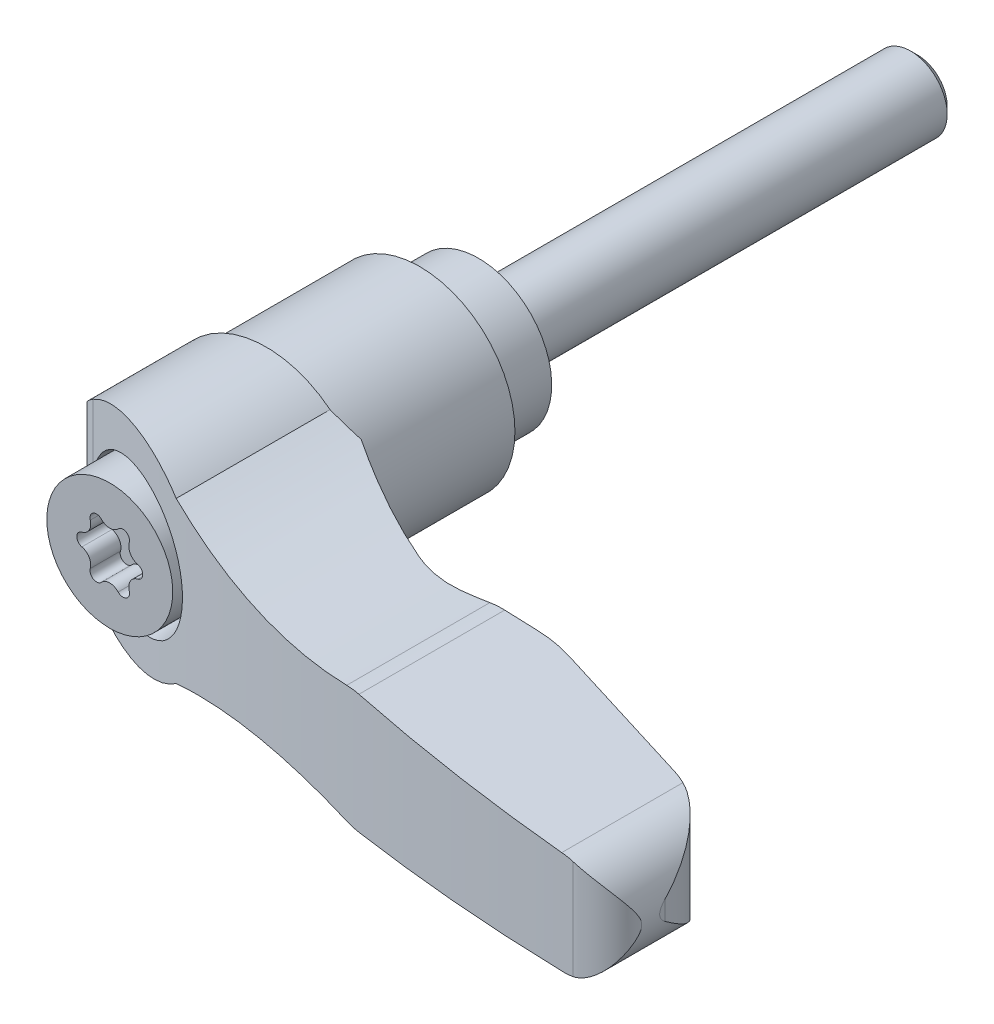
ISO-10303-21;
HEADER;
FILE_DESCRIPTION(('STEP AP214'),'2;1');
FILE_NAME('part.step','',(''),(''),'','','');
FILE_SCHEMA(('AUTOMOTIVE_DESIGN { 1 0 10303 214 1 1 1 1 }'));
ENDSEC;
DATA;
#1=APPLICATION_CONTEXT('core data for automotive mechanical design processes');
#2=APPLICATION_PROTOCOL_DEFINITION('international standard','automotive_design',2000,#1);
#3=PRODUCT_CONTEXT('',#1,'mechanical');
#4=PRODUCT('Part','Part','',(#3));
#5=PRODUCT_RELATED_PRODUCT_CATEGORY('part','',(#4));
#6=PRODUCT_DEFINITION_FORMATION('','',#4);
#7=PRODUCT_DEFINITION_CONTEXT('part definition',#1,'design');
#8=PRODUCT_DEFINITION('design','',#6,#7);
#9=PRODUCT_DEFINITION_SHAPE('','',#8);
#10=(LENGTH_UNIT() NAMED_UNIT(*) SI_UNIT(.MILLI.,.METRE.));
#11=(NAMED_UNIT(*) PLANE_ANGLE_UNIT() SI_UNIT($,.RADIAN.));
#12=(NAMED_UNIT(*) SI_UNIT($,.STERADIAN.) SOLID_ANGLE_UNIT());
#13=UNCERTAINTY_MEASURE_WITH_UNIT(LENGTH_MEASURE(1.E-05),#10,'distance_accuracy_value','');
#14=(GEOMETRIC_REPRESENTATION_CONTEXT(3) GLOBAL_UNCERTAINTY_ASSIGNED_CONTEXT((#13)) GLOBAL_UNIT_ASSIGNED_CONTEXT((#10,
#11,#12)) REPRESENTATION_CONTEXT('',''));
#15=CARTESIAN_POINT('',(0.,0.,0.));
#16=DIRECTION('',(0.,0.,1.));
#17=DIRECTION('',(1.,0.,0.));
#18=AXIS2_PLACEMENT_3D('',#15,#16,#17);
#19=CARTESIAN_POINT('',(2.008532,0.,-30.));
#20=DIRECTION('',(0.,0.,-1.));
#21=DIRECTION('',(0.,1.,0.));
#22=AXIS2_PLACEMENT_3D('',#19,#20,#21);
#23=PLANE('',#22);
#24=CARTESIAN_POINT('',(0.,0.,-30.));
#25=DIRECTION('',(0.,0.,1.));
#26=DIRECTION('',(0.,-1.,0.));
#27=AXIS2_PLACEMENT_3D('',#24,#25,#26);
#28=CIRCLE('',#27,2.008532);
#29=CARTESIAN_POINT('',(0.,-2.008532,-30.));
#30=VERTEX_POINT('',#29);
#31=EDGE_CURVE('E1326',#30,#30,#28,.T.);
#32=ORIENTED_EDGE('',*,*,#31,.F.);
#33=EDGE_LOOP('',(#32));
#34=FACE_BOUND('',#33,.T.);
#35=ADVANCED_FACE('F14',(#34),#23,.T.);
#36=CARTESIAN_POINT('',(0.,0.,-29.508532));
#37=DIRECTION('',(0.,0.,1.));
#38=DIRECTION('',(0.,-1.,0.));
#39=AXIS2_PLACEMENT_3D('',#36,#37,#38);
#40=CONICAL_SURFACE('',#39,2.5,0.785398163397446);
#41=ORIENTED_EDGE('',*,*,#31,.T.);
#42=EDGE_LOOP('',(#41));
#43=FACE_BOUND('',#42,.T.);
#44=CARTESIAN_POINT('',(0.,0.,-29.508532));
#45=DIRECTION('',(0.,0.,1.));
#46=DIRECTION('',(0.,-1.,0.));
#47=AXIS2_PLACEMENT_3D('',#44,#45,#46);
#48=CIRCLE('',#47,2.5);
#49=CARTESIAN_POINT('',(0.,-2.5,-29.508532));
#50=VERTEX_POINT('',#49);
#51=EDGE_CURVE('E1323',#50,#50,#48,.T.);
#52=ORIENTED_EDGE('',*,*,#51,.F.);
#53=EDGE_LOOP('',(#52));
#54=FACE_BOUND('',#53,.T.);
#55=ADVANCED_FACE('F638',(#43,#54),#40,.T.);
#56=CARTESIAN_POINT('',(0.,0.,4.));
#57=DIRECTION('',(0.,0.,1.));
#58=DIRECTION('',(0.,-1.,0.));
#59=AXIS2_PLACEMENT_3D('',#56,#57,#58);
#60=CYLINDRICAL_SURFACE('',#59,2.5);
#61=ORIENTED_EDGE('',*,*,#51,.T.);
#62=EDGE_LOOP('',(#61));
#63=FACE_BOUND('',#62,.T.);
#64=CARTESIAN_POINT('',(0.,0.,0.));
#65=DIRECTION('',(0.,0.,1.));
#66=DIRECTION('',(0.,-1.,0.));
#67=AXIS2_PLACEMENT_3D('',#64,#65,#66);
#68=CIRCLE('',#67,2.5);
#69=CARTESIAN_POINT('',(0.,-2.5,0.));
#70=VERTEX_POINT('',#69);
#71=EDGE_CURVE('E1320',#70,#70,#68,.T.);
#72=ORIENTED_EDGE('',*,*,#71,.F.);
#73=EDGE_LOOP('',(#72));
#74=FACE_BOUND('',#73,.T.);
#75=ADVANCED_FACE('F634',(#63,#74),#60,.T.);
#76=CARTESIAN_POINT('',(5.,0.,0.));
#77=DIRECTION('',(0.,0.,-1.));
#78=DIRECTION('',(0.,1.,0.));
#79=AXIS2_PLACEMENT_3D('',#76,#77,#78);
#80=PLANE('',#79);
#81=ORIENTED_EDGE('',*,*,#71,.T.);
#82=EDGE_LOOP('',(#81));
#83=FACE_BOUND('',#82,.T.);
#84=CARTESIAN_POINT('',(0.,0.,0.));
#85=DIRECTION('',(0.,0.,1.));
#86=DIRECTION('',(0.,-1.,0.));
#87=AXIS2_PLACEMENT_3D('',#84,#85,#86);
#88=CIRCLE('',#87,5.);
#89=CARTESIAN_POINT('',(0.,-5.,0.));
#90=VERTEX_POINT('',#89);
#91=EDGE_CURVE('E1317',#90,#90,#88,.T.);
#92=ORIENTED_EDGE('',*,*,#91,.F.);
#93=EDGE_LOOP('',(#92));
#94=FACE_BOUND('',#93,.T.);
#95=ADVANCED_FACE('F630',(#83,#94),#80,.T.);
#96=CARTESIAN_POINT('',(0.,0.,4.));
#97=DIRECTION('',(0.,0.,1.));
#98=DIRECTION('',(0.,-1.,0.));
#99=AXIS2_PLACEMENT_3D('',#96,#97,#98);
#100=CYLINDRICAL_SURFACE('',#99,5.);
#101=ORIENTED_EDGE('',*,*,#91,.T.);
#102=EDGE_LOOP('',(#101));
#103=FACE_BOUND('',#102,.T.);
#104=CARTESIAN_POINT('',(0.,0.,4.55));
#105=DIRECTION('',(0.,0.,1.));
#106=DIRECTION('',(0.,-1.,0.));
#107=AXIS2_PLACEMENT_3D('',#104,#105,#106);
#108=CIRCLE('',#107,5.);
#109=CARTESIAN_POINT('',(0.,-5.,4.55));
#110=VERTEX_POINT('',#109);
#111=EDGE_CURVE('E1273',#110,#110,#108,.T.);
#112=ORIENTED_EDGE('',*,*,#111,.F.);
#113=EDGE_LOOP('',(#112));
#114=FACE_BOUND('',#113,.T.);
#115=ADVANCED_FACE('F626',(#103,#114),#100,.T.);
#116=CARTESIAN_POINT('',(-1.94278209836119,0.602050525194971,23.12));
#117=DIRECTION('',(0.,0.,-1.));
#118=DIRECTION('',(0.,1.,0.));
#119=AXIS2_PLACEMENT_3D('',#116,#117,#118);
#120=PLANE('',#119);
#121=CARTESIAN_POINT('',(-2.08556419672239,1.20410105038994,23.12));
#122=DIRECTION('',(0.,0.,-1.));
#123=DIRECTION('',(-1.,0.,0.));
#124=AXIS2_PLACEMENT_3D('',#121,#122,#123);
#125=CIRCLE('',#124,0.787499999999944);
#126=CARTESIAN_POINT('',(-1.3311142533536,1.4298476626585,23.12));
#127=VERTEX_POINT('',#126);
#128=CARTESIAN_POINT('',(-1.9038415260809,0.43785492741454,23.12));
#129=VERTEX_POINT('',#128);
#130=EDGE_CURVE('E1353',#127,#129,#125,.T.);
#131=ORIENTED_EDGE('',*,*,#130,.T.);
#132=CARTESIAN_POINT('',(-1.8,0.,23.12));
#133=DIRECTION('',(0.,0.,1.));
#134=DIRECTION('',(1.,0.,0.));
#135=AXIS2_PLACEMENT_3D('',#132,#133,#134);
#136=CIRCLE('',#135,0.45);
#137=CARTESIAN_POINT('',(-1.9038415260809,-0.43785492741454,23.12));
#138=VERTEX_POINT('',#137);
#139=EDGE_CURVE('E1357',#129,#138,#136,.T.);
#140=ORIENTED_EDGE('',*,*,#139,.T.);
#141=CARTESIAN_POINT('',(-2.08556419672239,-1.20410105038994,23.12));
#142=DIRECTION('',(0.,0.,-1.));
#143=DIRECTION('',(-1.,0.,0.));
#144=AXIS2_PLACEMENT_3D('',#141,#142,#143);
#145=CIRCLE('',#144,0.787499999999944);
#146=CARTESIAN_POINT('',(-1.3311142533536,-1.4298476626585,23.12));
#147=VERTEX_POINT('',#146);
#148=EDGE_CURVE('E1393',#138,#147,#145,.T.);
#149=ORIENTED_EDGE('',*,*,#148,.T.);
#150=CARTESIAN_POINT('',(-0.899999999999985,-1.55884572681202,23.12));
#151=DIRECTION('',(0.,0.,1.));
#152=DIRECTION('',(1.,0.,0.));
#153=AXIS2_PLACEMENT_3D('',#150,#151,#152);
#154=CIRCLE('',#153,0.45);
#155=CARTESIAN_POINT('',(-0.57272727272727,-1.8677025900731,23.12));
#156=VERTEX_POINT('',#155);
#157=EDGE_CURVE('E1389',#147,#156,#154,.T.);
#158=ORIENTED_EDGE('',*,*,#157,.T.);
#159=CARTESIAN_POINT('',(0.,-2.40820210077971,23.12));
#160=DIRECTION('',(0.,0.,-1.));
#161=DIRECTION('',(-1.,0.,0.));
#162=AXIS2_PLACEMENT_3D('',#159,#160,#161);
#163=CIRCLE('',#162,0.787499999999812);
#164=CARTESIAN_POINT('',(0.57272727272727,-1.8677025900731,23.12));
#165=VERTEX_POINT('',#164);
#166=EDGE_CURVE('E1385',#156,#165,#163,.T.);
#167=ORIENTED_EDGE('',*,*,#166,.T.);
#168=CARTESIAN_POINT('',(0.899999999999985,-1.55884572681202,23.12));
#169=DIRECTION('',(0.,0.,1.));
#170=DIRECTION('',(-1.,0.,0.));
#171=AXIS2_PLACEMENT_3D('',#168,#169,#170);
#172=CIRCLE('',#171,0.45);
#173=CARTESIAN_POINT('',(1.3311142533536,-1.4298476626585,23.12));
#174=VERTEX_POINT('',#173);
#175=EDGE_CURVE('E1381',#165,#174,#172,.T.);
#176=ORIENTED_EDGE('',*,*,#175,.T.);
#177=CARTESIAN_POINT('',(2.08556419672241,-1.20410105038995,23.12));
#178=DIRECTION('',(0.,0.,-1.));
#179=DIRECTION('',(1.,0.,0.));
#180=AXIS2_PLACEMENT_3D('',#177,#178,#179);
#181=CIRCLE('',#180,0.787499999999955);
#182=CARTESIAN_POINT('',(1.9038415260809,-0.43785492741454,23.12));
#183=VERTEX_POINT('',#182);
#184=EDGE_CURVE('E1377',#174,#183,#181,.T.);
#185=ORIENTED_EDGE('',*,*,#184,.T.);
#186=CARTESIAN_POINT('',(1.8,0.,23.12));
#187=DIRECTION('',(0.,0.,1.));
#188=DIRECTION('',(-1.,0.,0.));
#189=AXIS2_PLACEMENT_3D('',#186,#187,#188);
#190=CIRCLE('',#189,0.45);
#191=CARTESIAN_POINT('',(1.9038415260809,0.43785492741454,23.12));
#192=VERTEX_POINT('',#191);
#193=EDGE_CURVE('E1373',#183,#192,#190,.T.);
#194=ORIENTED_EDGE('',*,*,#193,.T.);
#195=CARTESIAN_POINT('',(2.08556419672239,1.20410105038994,23.12));
#196=DIRECTION('',(0.,0.,-1.));
#197=DIRECTION('',(1.,0.,0.));
#198=AXIS2_PLACEMENT_3D('',#195,#196,#197);
#199=CIRCLE('',#198,0.787499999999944);
#200=CARTESIAN_POINT('',(1.3311142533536,1.4298476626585,23.12));
#201=VERTEX_POINT('',#200);
#202=EDGE_CURVE('E1369',#192,#201,#199,.T.);
#203=ORIENTED_EDGE('',*,*,#202,.T.);
#204=CARTESIAN_POINT('',(0.899999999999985,1.55884572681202,23.12));
#205=DIRECTION('',(0.,0.,1.));
#206=DIRECTION('',(-1.,0.,0.));
#207=AXIS2_PLACEMENT_3D('',#204,#205,#206);
#208=CIRCLE('',#207,0.45);
#209=CARTESIAN_POINT('',(0.57272727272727,1.8677025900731,23.12));
#210=VERTEX_POINT('',#209);
#211=EDGE_CURVE('E1365',#201,#210,#208,.T.);
#212=ORIENTED_EDGE('',*,*,#211,.T.);
#213=CARTESIAN_POINT('',(0.,2.40820210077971,23.12));
#214=DIRECTION('',(0.,0.,-1.));
#215=DIRECTION('',(-1.,0.,0.));
#216=AXIS2_PLACEMENT_3D('',#213,#214,#215);
#217=CIRCLE('',#216,0.787499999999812);
#218=CARTESIAN_POINT('',(-0.57272727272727,1.8677025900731,23.12));
#219=VERTEX_POINT('',#218);
#220=EDGE_CURVE('E1361',#210,#219,#217,.T.);
#221=ORIENTED_EDGE('',*,*,#220,.T.);
#222=CARTESIAN_POINT('',(-0.899999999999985,1.55884572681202,23.12));
#223=DIRECTION('',(0.,0.,1.));
#224=DIRECTION('',(1.,0.,0.));
#225=AXIS2_PLACEMENT_3D('',#222,#223,#224);
#226=CIRCLE('',#225,0.45);
#227=EDGE_CURVE('E1352',#219,#127,#226,.T.);
#228=ORIENTED_EDGE('',*,*,#227,.T.);
#229=EDGE_LOOP('',(#131,#140,#149,#158,#167,#176,#185,#194,#203,#212,#221,#228));
#230=FACE_BOUND('',#229,.T.);
#231=ADVANCED_FACE('F629',(#230),#120,.F.);
#232=CARTESIAN_POINT('',(-2.08556419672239,-1.20410105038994,27.24));
#233=DIRECTION('',(0.,0.,-1.));
#234=DIRECTION('',(0.,1.,0.));
#235=AXIS2_PLACEMENT_3D('',#232,#233,#234);
#236=CYLINDRICAL_SURFACE('',#235,0.787499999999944);
#237=DIRECTION('',(0.,0.,-1.));
#238=VECTOR('',#237,1.);
#239=CARTESIAN_POINT('',(-1.3311142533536,-1.4298476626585,27.24));
#240=LINE('',#239,#238);
#241=CARTESIAN_POINT('',(-1.3311142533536,-1.4298476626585,25.18));
#242=VERTEX_POINT('',#241);
#243=EDGE_CURVE('E1333',#242,#147,#240,.T.);
#244=ORIENTED_EDGE('',*,*,#243,.T.);
#245=ORIENTED_EDGE('',*,*,#148,.F.);
#246=DIRECTION('',(0.,0.,-1.));
#247=VECTOR('',#246,1.);
#248=CARTESIAN_POINT('',(-1.9038415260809,-0.43785492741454,27.24));
#249=LINE('',#248,#247);
#250=CARTESIAN_POINT('',(-1.9038415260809,-0.43785492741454,25.18));
#251=VERTEX_POINT('',#250);
#252=EDGE_CURVE('E1331',#251,#138,#249,.T.);
#253=ORIENTED_EDGE('',*,*,#252,.F.);
#254=CARTESIAN_POINT('',(-2.08556419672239,-1.20410105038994,25.18));
#255=DIRECTION('',(0.,0.,1.));
#256=DIRECTION('',(0.,-1.,0.));
#257=AXIS2_PLACEMENT_3D('',#254,#255,#256);
#258=CIRCLE('',#257,0.787499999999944);
#259=EDGE_CURVE('E1284',#242,#251,#258,.T.);
#260=ORIENTED_EDGE('',*,*,#259,.F.);
#261=EDGE_LOOP('',(#244,#245,#253,#260));
#262=FACE_BOUND('',#261,.T.);
#263=ADVANCED_FACE('F654',(#262),#236,.T.);
#264=CARTESIAN_POINT('',(-0.899999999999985,-1.55884572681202,27.24));
#265=DIRECTION('',(0.,0.,-1.));
#266=DIRECTION('',(0.,1.,0.));
#267=AXIS2_PLACEMENT_3D('',#264,#265,#266);
#268=CYLINDRICAL_SURFACE('',#267,0.45);
#269=DIRECTION('',(0.,0.,-1.));
#270=VECTOR('',#269,1.);
#271=CARTESIAN_POINT('',(-0.57272727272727,-1.8677025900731,27.24));
#272=LINE('',#271,#270);
#273=CARTESIAN_POINT('',(-0.57272727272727,-1.8677025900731,25.18));
#274=VERTEX_POINT('',#273);
#275=EDGE_CURVE('E1335',#274,#156,#272,.T.);
#276=ORIENTED_EDGE('',*,*,#275,.T.);
#277=ORIENTED_EDGE('',*,*,#157,.F.);
#278=ORIENTED_EDGE('',*,*,#243,.F.);
#279=CARTESIAN_POINT('',(-0.899999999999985,-1.55884572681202,25.18));
#280=DIRECTION('',(0.,0.,1.));
#281=DIRECTION('',(0.,-1.,0.));
#282=AXIS2_PLACEMENT_3D('',#279,#280,#281);
#283=CIRCLE('',#282,0.45);
#284=EDGE_CURVE('E1286',#274,#242,#283,.F.);
#285=ORIENTED_EDGE('',*,*,#284,.F.);
#286=EDGE_LOOP('',(#276,#277,#278,#285));
#287=FACE_BOUND('',#286,.T.);
#288=ADVANCED_FACE('F657',(#287),#268,.F.);
#289=CARTESIAN_POINT('',(0.,-2.40820210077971,27.24));
#290=DIRECTION('',(0.,0.,-1.));
#291=DIRECTION('',(0.,1.,0.));
#292=AXIS2_PLACEMENT_3D('',#289,#290,#291);
#293=CYLINDRICAL_SURFACE('',#292,0.787499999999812);
#294=DIRECTION('',(0.,0.,-1.));
#295=VECTOR('',#294,1.);
#296=CARTESIAN_POINT('',(0.57272727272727,-1.8677025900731,27.24));
#297=LINE('',#296,#295);
#298=CARTESIAN_POINT('',(0.57272727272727,-1.8677025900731,25.18));
#299=VERTEX_POINT('',#298);
#300=EDGE_CURVE('E1337',#299,#165,#297,.T.);
#301=ORIENTED_EDGE('',*,*,#300,.T.);
#302=ORIENTED_EDGE('',*,*,#166,.F.);
#303=ORIENTED_EDGE('',*,*,#275,.F.);
#304=CARTESIAN_POINT('',(0.,-2.40820210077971,25.18));
#305=DIRECTION('',(0.,0.,1.));
#306=DIRECTION('',(0.,-1.,0.));
#307=AXIS2_PLACEMENT_3D('',#304,#305,#306);
#308=CIRCLE('',#307,0.787499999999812);
#309=EDGE_CURVE('E1291',#299,#274,#308,.T.);
#310=ORIENTED_EDGE('',*,*,#309,.F.);
#311=EDGE_LOOP('',(#301,#302,#303,#310));
#312=FACE_BOUND('',#311,.T.);
#313=ADVANCED_FACE('F661',(#312),#293,.T.);
#314=CARTESIAN_POINT('',(0.899999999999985,-1.55884572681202,27.24));
#315=DIRECTION('',(0.,0.,-1.));
#316=DIRECTION('',(0.,1.,0.));
#317=AXIS2_PLACEMENT_3D('',#314,#315,#316);
#318=CYLINDRICAL_SURFACE('',#317,0.45);
#319=DIRECTION('',(0.,0.,-1.));
#320=VECTOR('',#319,1.);
#321=CARTESIAN_POINT('',(1.3311142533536,-1.4298476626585,27.24));
#322=LINE('',#321,#320);
#323=CARTESIAN_POINT('',(1.3311142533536,-1.4298476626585,25.18));
#324=VERTEX_POINT('',#323);
#325=EDGE_CURVE('E1339',#324,#174,#322,.T.);
#326=ORIENTED_EDGE('',*,*,#325,.T.);
#327=ORIENTED_EDGE('',*,*,#175,.F.);
#328=ORIENTED_EDGE('',*,*,#300,.F.);
#329=CARTESIAN_POINT('',(0.899999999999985,-1.55884572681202,25.18));
#330=DIRECTION('',(0.,0.,1.));
#331=DIRECTION('',(0.,-1.,0.));
#332=AXIS2_PLACEMENT_3D('',#329,#330,#331);
#333=CIRCLE('',#332,0.45);
#334=EDGE_CURVE('E1294',#324,#299,#333,.F.);
#335=ORIENTED_EDGE('',*,*,#334,.F.);
#336=EDGE_LOOP('',(#326,#327,#328,#335));
#337=FACE_BOUND('',#336,.T.);
#338=ADVANCED_FACE('F665',(#337),#318,.F.);
#339=CARTESIAN_POINT('',(2.08556419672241,-1.20410105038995,27.24));
#340=DIRECTION('',(0.,0.,-1.));
#341=DIRECTION('',(0.,1.,0.));
#342=AXIS2_PLACEMENT_3D('',#339,#340,#341);
#343=CYLINDRICAL_SURFACE('',#342,0.787499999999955);
#344=DIRECTION('',(0.,0.,-1.));
#345=VECTOR('',#344,1.);
#346=CARTESIAN_POINT('',(1.9038415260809,-0.43785492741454,27.24));
#347=LINE('',#346,#345);
#348=CARTESIAN_POINT('',(1.9038415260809,-0.43785492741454,25.18));
#349=VERTEX_POINT('',#348);
#350=EDGE_CURVE('E1341',#349,#183,#347,.T.);
#351=ORIENTED_EDGE('',*,*,#350,.T.);
#352=ORIENTED_EDGE('',*,*,#184,.F.);
#353=ORIENTED_EDGE('',*,*,#325,.F.);
#354=CARTESIAN_POINT('',(2.08556419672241,-1.20410105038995,25.18));
#355=DIRECTION('',(0.,0.,1.));
#356=DIRECTION('',(0.,-1.,0.));
#357=AXIS2_PLACEMENT_3D('',#354,#355,#356);
#358=CIRCLE('',#357,0.787499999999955);
#359=EDGE_CURVE('E1297',#349,#324,#358,.T.);
#360=ORIENTED_EDGE('',*,*,#359,.F.);
#361=EDGE_LOOP('',(#351,#352,#353,#360));
#362=FACE_BOUND('',#361,.T.);
#363=ADVANCED_FACE('F669',(#362),#343,.T.);
#364=CARTESIAN_POINT('',(1.8,0.,27.24));
#365=DIRECTION('',(0.,0.,-1.));
#366=DIRECTION('',(0.,1.,0.));
#367=AXIS2_PLACEMENT_3D('',#364,#365,#366);
#368=CYLINDRICAL_SURFACE('',#367,0.45);
#369=DIRECTION('',(0.,0.,-1.));
#370=VECTOR('',#369,1.);
#371=CARTESIAN_POINT('',(1.9038415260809,0.43785492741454,27.24));
#372=LINE('',#371,#370);
#373=CARTESIAN_POINT('',(1.9038415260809,0.43785492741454,25.18));
#374=VERTEX_POINT('',#373);
#375=EDGE_CURVE('E1343',#374,#192,#372,.T.);
#376=ORIENTED_EDGE('',*,*,#375,.T.);
#377=ORIENTED_EDGE('',*,*,#193,.F.);
#378=ORIENTED_EDGE('',*,*,#350,.F.);
#379=CARTESIAN_POINT('',(1.8,0.,25.18));
#380=DIRECTION('',(0.,0.,1.));
#381=DIRECTION('',(0.,-1.,0.));
#382=AXIS2_PLACEMENT_3D('',#379,#380,#381);
#383=CIRCLE('',#382,0.45);
#384=EDGE_CURVE('E1300',#374,#349,#383,.F.);
#385=ORIENTED_EDGE('',*,*,#384,.F.);
#386=EDGE_LOOP('',(#376,#377,#378,#385));
#387=FACE_BOUND('',#386,.T.);
#388=ADVANCED_FACE('F673',(#387),#368,.F.);
#389=CARTESIAN_POINT('',(2.08556419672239,1.20410105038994,27.24));
#390=DIRECTION('',(0.,0.,-1.));
#391=DIRECTION('',(0.,1.,0.));
#392=AXIS2_PLACEMENT_3D('',#389,#390,#391);
#393=CYLINDRICAL_SURFACE('',#392,0.787499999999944);
#394=DIRECTION('',(0.,0.,-1.));
#395=VECTOR('',#394,1.);
#396=CARTESIAN_POINT('',(1.3311142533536,1.4298476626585,27.24));
#397=LINE('',#396,#395);
#398=CARTESIAN_POINT('',(1.3311142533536,1.4298476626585,25.18));
#399=VERTEX_POINT('',#398);
#400=EDGE_CURVE('E1345',#399,#201,#397,.T.);
#401=ORIENTED_EDGE('',*,*,#400,.T.);
#402=ORIENTED_EDGE('',*,*,#202,.F.);
#403=ORIENTED_EDGE('',*,*,#375,.F.);
#404=CARTESIAN_POINT('',(2.08556419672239,1.20410105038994,25.18));
#405=DIRECTION('',(0.,0.,1.));
#406=DIRECTION('',(0.,-1.,0.));
#407=AXIS2_PLACEMENT_3D('',#404,#405,#406);
#408=CIRCLE('',#407,0.787499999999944);
#409=EDGE_CURVE('E1303',#399,#374,#408,.T.);
#410=ORIENTED_EDGE('',*,*,#409,.F.);
#411=EDGE_LOOP('',(#401,#402,#403,#410));
#412=FACE_BOUND('',#411,.T.);
#413=ADVANCED_FACE('F677',(#412),#393,.T.);
#414=CARTESIAN_POINT('',(0.899999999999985,1.55884572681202,27.24));
#415=DIRECTION('',(0.,0.,-1.));
#416=DIRECTION('',(0.,1.,0.));
#417=AXIS2_PLACEMENT_3D('',#414,#415,#416);
#418=CYLINDRICAL_SURFACE('',#417,0.45);
#419=DIRECTION('',(0.,0.,-1.));
#420=VECTOR('',#419,1.);
#421=CARTESIAN_POINT('',(0.57272727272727,1.8677025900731,27.24));
#422=LINE('',#421,#420);
#423=CARTESIAN_POINT('',(0.57272727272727,1.8677025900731,25.18));
#424=VERTEX_POINT('',#423);
#425=EDGE_CURVE('E1347',#424,#210,#422,.T.);
#426=ORIENTED_EDGE('',*,*,#425,.T.);
#427=ORIENTED_EDGE('',*,*,#211,.F.);
#428=ORIENTED_EDGE('',*,*,#400,.F.);
#429=CARTESIAN_POINT('',(0.899999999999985,1.55884572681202,25.18));
#430=DIRECTION('',(0.,0.,1.));
#431=DIRECTION('',(0.,-1.,0.));
#432=AXIS2_PLACEMENT_3D('',#429,#430,#431);
#433=CIRCLE('',#432,0.45);
#434=EDGE_CURVE('E1306',#424,#399,#433,.F.);
#435=ORIENTED_EDGE('',*,*,#434,.F.);
#436=EDGE_LOOP('',(#426,#427,#428,#435));
#437=FACE_BOUND('',#436,.T.);
#438=ADVANCED_FACE('F681',(#437),#418,.F.);
#439=CARTESIAN_POINT('',(0.,2.40820210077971,27.24));
#440=DIRECTION('',(0.,0.,-1.));
#441=DIRECTION('',(0.,1.,0.));
#442=AXIS2_PLACEMENT_3D('',#439,#440,#441);
#443=CYLINDRICAL_SURFACE('',#442,0.787499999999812);
#444=DIRECTION('',(0.,0.,-1.));
#445=VECTOR('',#444,1.);
#446=CARTESIAN_POINT('',(-0.57272727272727,1.8677025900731,27.24));
#447=LINE('',#446,#445);
#448=CARTESIAN_POINT('',(-0.57272727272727,1.8677025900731,25.18));
#449=VERTEX_POINT('',#448);
#450=EDGE_CURVE('E113',#449,#219,#447,.T.);
#451=ORIENTED_EDGE('',*,*,#450,.T.);
#452=ORIENTED_EDGE('',*,*,#220,.F.);
#453=ORIENTED_EDGE('',*,*,#425,.F.);
#454=CARTESIAN_POINT('',(0.,2.40820210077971,25.18));
#455=DIRECTION('',(0.,0.,1.));
#456=DIRECTION('',(0.,-1.,0.));
#457=AXIS2_PLACEMENT_3D('',#454,#455,#456);
#458=CIRCLE('',#457,0.787499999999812);
#459=EDGE_CURVE('E1309',#449,#424,#458,.T.);
#460=ORIENTED_EDGE('',*,*,#459,.F.);
#461=EDGE_LOOP('',(#451,#452,#453,#460));
#462=FACE_BOUND('',#461,.T.);
#463=ADVANCED_FACE('F685',(#462),#443,.T.);
#464=CARTESIAN_POINT('',(-0.899999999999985,1.55884572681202,27.24));
#465=DIRECTION('',(0.,0.,-1.));
#466=DIRECTION('',(0.,1.,0.));
#467=AXIS2_PLACEMENT_3D('',#464,#465,#466);
#468=CYLINDRICAL_SURFACE('',#467,0.45);
#469=DIRECTION('',(0.,0.,-1.));
#470=VECTOR('',#469,1.);
#471=CARTESIAN_POINT('',(-1.3311142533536,1.4298476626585,27.24));
#472=LINE('',#471,#470);
#473=CARTESIAN_POINT('',(-1.3311142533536,1.4298476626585,25.18));
#474=VERTEX_POINT('',#473);
#475=EDGE_CURVE('E1350',#474,#127,#472,.T.);
#476=ORIENTED_EDGE('',*,*,#475,.T.);
#477=ORIENTED_EDGE('',*,*,#227,.F.);
#478=ORIENTED_EDGE('',*,*,#450,.F.);
#479=CARTESIAN_POINT('',(-0.899999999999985,1.55884572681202,25.18));
#480=DIRECTION('',(0.,0.,1.));
#481=DIRECTION('',(0.,-1.,0.));
#482=AXIS2_PLACEMENT_3D('',#479,#480,#481);
#483=CIRCLE('',#482,0.45);
#484=EDGE_CURVE('E1312',#474,#449,#483,.F.);
#485=ORIENTED_EDGE('',*,*,#484,.F.);
#486=EDGE_LOOP('',(#476,#477,#478,#485));
#487=FACE_BOUND('',#486,.T.);
#488=ADVANCED_FACE('F650',(#487),#468,.F.);
#489=CARTESIAN_POINT('',(-2.08556419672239,1.20410105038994,27.24));
#490=DIRECTION('',(0.,0.,-1.));
#491=DIRECTION('',(0.,1.,0.));
#492=AXIS2_PLACEMENT_3D('',#489,#490,#491);
#493=CYLINDRICAL_SURFACE('',#492,0.787499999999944);
#494=DIRECTION('',(0.,0.,-1.));
#495=VECTOR('',#494,1.);
#496=CARTESIAN_POINT('',(-1.9038415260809,0.43785492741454,27.24));
#497=LINE('',#496,#495);
#498=CARTESIAN_POINT('',(-1.9038415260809,0.43785492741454,25.18));
#499=VERTEX_POINT('',#498);
#500=EDGE_CURVE('E1329',#499,#129,#497,.T.);
#501=ORIENTED_EDGE('',*,*,#500,.T.);
#502=ORIENTED_EDGE('',*,*,#130,.F.);
#503=ORIENTED_EDGE('',*,*,#475,.F.);
#504=CARTESIAN_POINT('',(-2.08556419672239,1.20410105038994,25.18));
#505=DIRECTION('',(0.,0.,1.));
#506=DIRECTION('',(0.,-1.,0.));
#507=AXIS2_PLACEMENT_3D('',#504,#505,#506);
#508=CIRCLE('',#507,0.787499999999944);
#509=EDGE_CURVE('E18',#499,#474,#508,.T.);
#510=ORIENTED_EDGE('',*,*,#509,.F.);
#511=EDGE_LOOP('',(#501,#502,#503,#510));
#512=FACE_BOUND('',#511,.T.);
#513=ADVANCED_FACE('F647',(#512),#493,.T.);
#514=CARTESIAN_POINT('',(-1.8,0.,27.24));
#515=DIRECTION('',(0.,0.,-1.));
#516=DIRECTION('',(0.,1.,0.));
#517=AXIS2_PLACEMENT_3D('',#514,#515,#516);
#518=CYLINDRICAL_SURFACE('',#517,0.45);
#519=ORIENTED_EDGE('',*,*,#252,.T.);
#520=ORIENTED_EDGE('',*,*,#139,.F.);
#521=ORIENTED_EDGE('',*,*,#500,.F.);
#522=CARTESIAN_POINT('',(-1.8,0.,25.18));
#523=DIRECTION('',(0.,0.,1.));
#524=DIRECTION('',(0.,-1.,0.));
#525=AXIS2_PLACEMENT_3D('',#522,#523,#524);
#526=CIRCLE('',#525,0.45);
#527=EDGE_CURVE('E1280',#251,#499,#526,.F.);
#528=ORIENTED_EDGE('',*,*,#527,.F.);
#529=EDGE_LOOP('',(#519,#520,#521,#528));
#530=FACE_BOUND('',#529,.T.);
#531=ADVANCED_FACE('F621',(#530),#518,.F.);
#532=CARTESIAN_POINT('',(0.,0.,25.18));
#533=DIRECTION('',(0.,0.,1.));
#534=DIRECTION('',(0.,-1.,0.));
#535=AXIS2_PLACEMENT_3D('',#532,#533,#534);
#536=PLANE('',#535);
#537=CARTESIAN_POINT('',(0.,0.,25.18));
#538=DIRECTION('',(0.,0.,1.));
#539=DIRECTION('',(0.,-1.,0.));
#540=AXIS2_PLACEMENT_3D('',#537,#538,#539);
#541=CIRCLE('',#540,4.3);
#542=CARTESIAN_POINT('',(0.,-4.3,25.18));
#543=VERTEX_POINT('',#542);
#544=EDGE_CURVE('E1314',#543,#543,#541,.T.);
#545=ORIENTED_EDGE('',*,*,#544,.T.);
#546=EDGE_LOOP('',(#545));
#547=FACE_BOUND('',#546,.T.);
#548=ORIENTED_EDGE('',*,*,#527,.T.);
#549=ORIENTED_EDGE('',*,*,#509,.T.);
#550=ORIENTED_EDGE('',*,*,#484,.T.);
#551=ORIENTED_EDGE('',*,*,#459,.T.);
#552=ORIENTED_EDGE('',*,*,#434,.T.);
#553=ORIENTED_EDGE('',*,*,#409,.T.);
#554=ORIENTED_EDGE('',*,*,#384,.T.);
#555=ORIENTED_EDGE('',*,*,#359,.T.);
#556=ORIENTED_EDGE('',*,*,#334,.T.);
#557=ORIENTED_EDGE('',*,*,#309,.T.);
#558=ORIENTED_EDGE('',*,*,#284,.T.);
#559=ORIENTED_EDGE('',*,*,#259,.T.);
#560=EDGE_LOOP('',(#548,#549,#550,#551,#552,#553,#554,#555,#556,#557,#558,#559));
#561=FACE_BOUND('',#560,.T.);
#562=ADVANCED_FACE('F16',(#547,#561),#536,.T.);
#563=CARTESIAN_POINT('',(0.,0.,4.));
#564=DIRECTION('',(0.,0.,1.));
#565=DIRECTION('',(0.,-1.,0.));
#566=AXIS2_PLACEMENT_3D('',#563,#564,#565);
#567=CYLINDRICAL_SURFACE('',#566,4.3);
#568=CARTESIAN_POINT('',(0.,0.,21.34));
#569=DIRECTION('',(0.,0.,1.));
#570=DIRECTION('',(0.,-1.,0.));
#571=AXIS2_PLACEMENT_3D('',#568,#569,#570);
#572=CIRCLE('',#571,4.3);
#573=CARTESIAN_POINT('',(0.,-4.3,21.34));
#574=VERTEX_POINT('',#573);
#575=EDGE_CURVE('E1271',#574,#574,#572,.T.);
#576=ORIENTED_EDGE('',*,*,#575,.T.);
#577=EDGE_LOOP('',(#576));
#578=FACE_BOUND('',#577,.T.);
#579=ORIENTED_EDGE('',*,*,#544,.F.);
#580=EDGE_LOOP('',(#579));
#581=FACE_BOUND('',#580,.T.);
#582=ADVANCED_FACE('F610',(#578,#581),#567,.T.);
#583=CARTESIAN_POINT('',(39.938965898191,-8.,27.204249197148));
#584=DIRECTION('',(-0.989626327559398,0.,0.143665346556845));
#585=DIRECTION('',(-0.143665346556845,0.,-0.989626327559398));
#586=AXIS2_PLACEMENT_3D('',#583,#584,#585);
#587=PLANE('',#586);
#588=CARTESIAN_POINT('',(36.5,0.,3.51522972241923));
#589=DIRECTION('',(-0.989626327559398,0.,0.143665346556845));
#590=DIRECTION('',(0.143665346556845,0.,0.989626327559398));
#591=AXIS2_PLACEMENT_3D('',#588,#589,#590);
#592=ELLIPSE('',#591,24.3621728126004,3.5);
#593=CARTESIAN_POINT('',(39.938965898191,-0.650779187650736,27.204249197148));
#594=VERTEX_POINT('',#593);
#595=CARTESIAN_POINT('',(39.938965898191,0.650779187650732,27.204249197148));
#596=VERTEX_POINT('',#595);
#597=EDGE_CURVE('E438',#594,#596,#592,.T.);
#598=ORIENTED_EDGE('',*,*,#597,.F.);
#599=DIRECTION('',(0.,1.,0.));
#600=VECTOR('',#599,1.);
#601=CARTESIAN_POINT('',(39.938965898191,-8.,27.204249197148));
#602=LINE('',#601,#600);
#603=EDGE_CURVE('E283',#594,#596,#602,.T.);
#604=ORIENTED_EDGE('',*,*,#603,.T.);
#605=EDGE_LOOP('',(#598,#604));
#606=FACE_BOUND('',#605,.T.);
#607=ADVANCED_FACE('F449',(#606),#587,.F.);
#608=CARTESIAN_POINT('',(33.8626602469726,-8.,28.0863544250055));
#609=DIRECTION('',(0.,1.,0.));
#610=DIRECTION('',(-1.,0.,0.));
#611=AXIS2_PLACEMENT_3D('',#608,#609,#610);
#612=CYLINDRICAL_SURFACE('',#611,6.14000000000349);
#613=CARTESIAN_POINT('',(33.8626602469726,3.59762871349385,28.0863544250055));
#614=DIRECTION('',(0.0369925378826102,0.999315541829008,0.));
#615=DIRECTION('',(-0.999315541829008,0.0369925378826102,0.));
#616=AXIS2_PLACEMENT_3D('',#613,#614,#615);
#617=ELLIPSE('',#616,6.14420545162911,6.14000000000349);
#618=CARTESIAN_POINT('',(36.5,3.5,22.5416236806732));
#619=VERTEX_POINT('',#618);
#620=CARTESIAN_POINT('',(35.534460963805,3.53574220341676,22.178335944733));
#621=VERTEX_POINT('',#620);
#622=EDGE_CURVE('E608',#619,#621,#617,.T.);
#623=ORIENTED_EDGE('',*,*,#622,.F.);
#624=CARTESIAN_POINT('',(39.938965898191,0.650779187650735,27.204249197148));
#625=CARTESIAN_POINT('',(39.9247028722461,0.726086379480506,27.1059853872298));
#626=CARTESIAN_POINT('',(39.9079968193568,0.800887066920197,27.007686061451));
#627=CARTESIAN_POINT('',(39.8696347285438,0.949458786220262,26.8112602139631));
#628=CARTESIAN_POINT('',(39.8479781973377,1.02322971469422,26.7131337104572));
#629=CARTESIAN_POINT('',(39.7995979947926,1.16988012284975,26.5170899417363));
#630=CARTESIAN_POINT('',(39.7728626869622,1.24275713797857,26.4191736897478));
#631=CARTESIAN_POINT('',(39.7142815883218,1.38725410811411,26.2239599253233));
#632=CARTESIAN_POINT('',(39.6824358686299,1.45887408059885,26.1266624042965));
#633=CARTESIAN_POINT('',(39.5782917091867,1.67318502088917,25.8337016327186));
#634=CARTESIAN_POINT('',(39.4979263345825,1.81366367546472,25.6391889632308));
#635=CARTESIAN_POINT('',(39.3150854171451,2.08619457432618,25.2551202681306));
#636=CARTESIAN_POINT('',(39.2126344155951,2.21825596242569,25.0655590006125));
#637=CARTESIAN_POINT('',(38.9595027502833,2.49877334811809,24.6523338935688));
#638=CARTESIAN_POINT('',(38.8031801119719,2.64456339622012,24.4302018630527));
#639=CARTESIAN_POINT('',(38.5417124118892,2.84488994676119,24.108275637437));
#640=CARTESIAN_POINT('',(38.4501831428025,2.90854134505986,24.0029632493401));
#641=CARTESIAN_POINT('',(38.2579442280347,3.02861213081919,23.7967186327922));
#642=CARTESIAN_POINT('',(38.1572360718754,3.08503268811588,23.6957856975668));
#643=CARTESIAN_POINT('',(37.8892625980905,3.21757634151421,23.4457323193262));
#644=CARTESIAN_POINT('',(37.7155213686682,3.28779061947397,23.3001643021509));
#645=CARTESIAN_POINT('',(37.4396992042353,3.37286339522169,23.0946053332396));
#646=CARTESIAN_POINT('',(37.3453175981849,3.39783246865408,23.0282732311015));
#647=CARTESIAN_POINT('',(37.1517842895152,3.44019984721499,22.9003457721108));
#648=CARTESIAN_POINT('',(37.0526354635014,3.45760265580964,22.8387476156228));
#649=CARTESIAN_POINT('',(36.8781783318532,3.48029211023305,22.7372021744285));
#650=CARTESIAN_POINT('',(36.8038676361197,3.48759914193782,22.6959814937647));
#651=CARTESIAN_POINT('',(36.6533047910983,3.49745586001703,22.6165121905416));
#652=CARTESIAN_POINT('',(36.5770513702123,3.50000234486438,22.57826558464));
#653=CARTESIAN_POINT('',(36.5,3.5,22.5416236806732));
#654=B_SPLINE_CURVE_WITH_KNOTS('',3,(#624,#625,#626,#627,#628,#629,#630,#631,#632,#633,#634,
#635,#636,#637,#638,#639,#640,#641,#642,#643,#644,#645,#646,#647,#648,#649,#650,#651,#652,#653),
.UNSPECIFIED.,.F.,.F.,(4,2,2,2,2,2,2,2,2,2,2,2,2,2,4),(0.,0.373839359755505,0.747715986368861,
1.1224598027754,1.49719840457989,2.25512351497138,3.01221072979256,3.93367725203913,
4.39332639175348,4.85290107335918,5.56171222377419,5.91546495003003,6.26900683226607,
6.52468766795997,6.78054039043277),.UNSPECIFIED.);
#655=EDGE_CURVE('E437',#596,#619,#654,.T.);
#656=ORIENTED_EDGE('',*,*,#655,.F.);
#657=ORIENTED_EDGE('',*,*,#603,.F.);
#658=CARTESIAN_POINT('',(36.5,-3.5,22.5416236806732));
#659=CARTESIAN_POINT('',(36.6061539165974,-3.50000941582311,22.5920863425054));
#660=CARTESIAN_POINT('',(36.7107657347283,-3.49517280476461,22.6456099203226));
#661=CARTESIAN_POINT('',(36.9160027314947,-3.47671082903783,22.7581011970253));
#662=CARTESIAN_POINT('',(37.016634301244,-3.46310021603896,22.8170596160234));
#663=CARTESIAN_POINT('',(37.212347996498,-3.42816986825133,22.9392782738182));
#664=CARTESIAN_POINT('',(37.3074768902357,-3.40693163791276,23.0024874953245));
#665=CARTESIAN_POINT('',(37.4929223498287,-3.35757592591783,23.1332068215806));
#666=CARTESIAN_POINT('',(37.5832363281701,-3.32945478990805,23.2007191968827));
#667=CARTESIAN_POINT('',(37.7830795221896,-3.2585052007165,23.3587409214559));
#668=CARTESIAN_POINT('',(37.8909927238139,-3.21376078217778,23.4504360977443));
#669=CARTESIAN_POINT('',(38.0982482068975,-3.11588681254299,23.6389903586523));
#670=CARTESIAN_POINT('',(38.1975840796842,-3.06275107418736,23.7358532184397));
#671=CARTESIAN_POINT('',(38.3880468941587,-2.94917464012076,23.934309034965));
#672=CARTESIAN_POINT('',(38.4791322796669,-2.88870020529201,24.035922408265));
#673=CARTESIAN_POINT('',(38.6526412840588,-2.761826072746,24.2426721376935));
#674=CARTESIAN_POINT('',(38.7350674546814,-2.69542813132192,24.3478074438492));
#675=CARTESIAN_POINT('',(38.9229341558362,-2.52996933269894,24.6038856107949));
#676=CARTESIAN_POINT('',(39.0243159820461,-2.42850340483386,24.7562617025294));
#677=CARTESIAN_POINT('',(39.2111706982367,-2.21796613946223,25.0654781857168));
#678=CARTESIAN_POINT('',(39.2966363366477,-2.10889136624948,25.2223205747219));
#679=CARTESIAN_POINT('',(39.4522229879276,-1.88493092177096,25.5392893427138));
#680=CARTESIAN_POINT('',(39.5223498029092,-1.77004746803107,25.6994144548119));
#681=CARTESIAN_POINT('',(39.6478320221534,-1.53583460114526,26.0220530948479));
#682=CARTESIAN_POINT('',(39.7031929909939,-1.41650688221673,26.1845656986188));
#683=CARTESIAN_POINT('',(39.7933776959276,-1.19018579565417,26.4900634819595));
#684=CARTESIAN_POINT('',(39.8299343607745,-1.08360162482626,26.6328455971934));
#685=CARTESIAN_POINT('',(39.8923391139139,-0.86858691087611,26.9185049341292));
#686=CARTESIAN_POINT('',(39.9182264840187,-0.760164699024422,27.0613798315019));
#687=CARTESIAN_POINT('',(39.938965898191,-0.650779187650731,27.204249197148));
#688=B_SPLINE_CURVE_WITH_KNOTS('',3,(#658,#659,#660,#661,#662,#663,#664,#665,#666,#667,#668,
#669,#670,#671,#672,#673,#674,#675,#676,#677,#678,#679,#680,#681,#682,#683,#684,#685,#686,#687),
.UNSPECIFIED.,.F.,.F.,(4,2,2,2,2,2,2,2,2,2,2,2,2,2,4),(0.,0.352350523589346,0.704110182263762,
1.05221781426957,1.40051067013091,1.84538152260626,2.29058194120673,2.73791274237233,
3.18511134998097,3.81198117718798,4.43913591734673,5.06605301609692,5.69273352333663,
6.23807905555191,6.78139842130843),.UNSPECIFIED.);
#689=CARTESIAN_POINT('',(36.5,-3.5,22.5416236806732));
#690=VERTEX_POINT('',#689);
#691=EDGE_CURVE('E431',#690,#594,#688,.T.);
#692=ORIENTED_EDGE('',*,*,#691,.F.);
#693=CARTESIAN_POINT('',(33.8626602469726,-3.59762871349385,28.0863544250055));
#694=DIRECTION('',(0.0369925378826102,-0.999315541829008,0.));
#695=DIRECTION('',(0.999315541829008,0.0369925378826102,0.));
#696=AXIS2_PLACEMENT_3D('',#693,#694,#695);
#697=ELLIPSE('',#696,6.14420545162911,6.14000000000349);
#698=CARTESIAN_POINT('',(35.534460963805,-3.53574220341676,22.178335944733));
#699=VERTEX_POINT('',#698);
#700=EDGE_CURVE('E593',#699,#690,#697,.T.);
#701=ORIENTED_EDGE('',*,*,#700,.F.);
#702=DIRECTION('',(0.,1.,0.));
#703=VECTOR('',#702,1.);
#704=CARTESIAN_POINT('',(35.534460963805,-8.,22.178335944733));
#705=LINE('',#704,#703);
#706=EDGE_CURVE('E286',#699,#621,#705,.T.);
#707=ORIENTED_EDGE('',*,*,#706,.T.);
#708=EDGE_LOOP('',(#623,#656,#657,#692,#701,#707));
#709=FACE_BOUND('',#708,.T.);
#710=ADVANCED_FACE('F444',(#709),#612,.T.);
#711=CARTESIAN_POINT('',(25.51080482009,-8.,19.34192715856));
#712=DIRECTION('',(-0.272280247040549,0.,0.962217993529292));
#713=DIRECTION('',(-0.962217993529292,0.,-0.272280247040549));
#714=AXIS2_PLACEMENT_3D('',#711,#712,#713);
#715=PLANE('',#714);
#716=DIRECTION('',(-0.961608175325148,0.0355966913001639,-0.272107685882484));
#717=VECTOR('',#716,1.);
#718=CARTESIAN_POINT('',(25.918375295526,3.8917092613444,19.457257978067));
#719=LINE('',#718,#717);
#720=CARTESIAN_POINT('',(25.51080482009,3.90679665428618,19.34192715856));
#721=VERTEX_POINT('',#720);
#722=EDGE_CURVE('E1457',#621,#721,#719,.T.);
#723=ORIENTED_EDGE('',*,*,#722,.F.);
#724=ORIENTED_EDGE('',*,*,#706,.F.);
#725=DIRECTION('',(0.961608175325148,0.0355966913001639,0.272107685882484));
#726=VECTOR('',#725,1.);
#727=CARTESIAN_POINT('',(25.3706941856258,-3.9119832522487,19.3022798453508));
#728=LINE('',#727,#726);
#729=CARTESIAN_POINT('',(25.51080482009,-3.90679665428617,19.34192715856));
#730=VERTEX_POINT('',#729);
#731=EDGE_CURVE('E595',#730,#699,#728,.T.);
#732=ORIENTED_EDGE('',*,*,#731,.F.);
#733=DIRECTION('',(0.,1.,0.));
#734=VECTOR('',#733,1.);
#735=CARTESIAN_POINT('',(25.51080482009,-8.,19.34192715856));
#736=LINE('',#735,#734);
#737=EDGE_CURVE('E289',#730,#721,#736,.T.);
#738=ORIENTED_EDGE('',*,*,#737,.T.);
#739=EDGE_LOOP('',(#723,#724,#732,#738));
#740=FACE_BOUND('',#739,.T.);
#741=ADVANCED_FACE('F448',(#740),#715,.F.);
#742=CARTESIAN_POINT('',(23.0466685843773,-8.,28.0499999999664));
#743=DIRECTION('',(0.,1.,0.));
#744=DIRECTION('',(-1.,0.,0.));
#745=AXIS2_PLACEMENT_3D('',#742,#743,#744);
#746=CYLINDRICAL_SURFACE('',#745,9.04999999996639);
#747=CARTESIAN_POINT('',(23.0466685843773,3.99801374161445,28.0499999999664));
#748=DIRECTION('',(0.0369925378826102,0.999315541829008,0.));
#749=DIRECTION('',(-0.999315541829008,0.0369925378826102,0.));
#750=AXIS2_PLACEMENT_3D('',#747,#748,#749);
#751=ELLIPSE('',#750,9.05619858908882,9.04999999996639);
#752=CARTESIAN_POINT('',(23.046668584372,3.99801374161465,19.));
#753=VERTEX_POINT('',#752);
#754=EDGE_CURVE('E1452',#721,#753,#751,.T.);
#755=ORIENTED_EDGE('',*,*,#754,.F.);
#756=ORIENTED_EDGE('',*,*,#737,.F.);
#757=CARTESIAN_POINT('',(23.0466685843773,-3.99801374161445,28.0499999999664));
#758=DIRECTION('',(0.0369925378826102,-0.999315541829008,0.));
#759=DIRECTION('',(0.999315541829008,0.0369925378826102,0.));
#760=AXIS2_PLACEMENT_3D('',#757,#758,#759);
#761=ELLIPSE('',#760,9.05619858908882,9.04999999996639);
#762=CARTESIAN_POINT('',(23.046668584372,-3.99801374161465,19.));
#763=VERTEX_POINT('',#762);
#764=EDGE_CURVE('E597',#763,#730,#761,.T.);
#765=ORIENTED_EDGE('',*,*,#764,.F.);
#766=DIRECTION('',(0.,1.,0.));
#767=VECTOR('',#766,1.);
#768=CARTESIAN_POINT('',(23.046668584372,-8.,19.));
#769=LINE('',#768,#767);
#770=EDGE_CURVE('E292',#763,#753,#769,.T.);
#771=ORIENTED_EDGE('',*,*,#770,.T.);
#772=EDGE_LOOP('',(#755,#756,#765,#771));
#773=FACE_BOUND('',#772,.T.);
#774=ADVANCED_FACE('F454',(#773),#746,.T.);
#775=CARTESIAN_POINT('',(17.750423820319,-8.,19.));
#776=DIRECTION('',(0.,0.,1.));
#777=DIRECTION('',(0.,-1.,0.));
#778=AXIS2_PLACEMENT_3D('',#775,#776,#777);
#779=PLANE('',#778);
#780=CARTESIAN_POINT('',(14.8,33.6,19.));
#781=DIRECTION('',(0.,0.,1.));
#782=DIRECTION('',(0.,-1.,0.));
#783=AXIS2_PLACEMENT_3D('',#780,#781,#782);
#784=CIRCLE('',#783,30.);
#785=CARTESIAN_POINT('',(19.776621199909,4.0156588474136,19.));
#786=VERTEX_POINT('',#785);
#787=CARTESIAN_POINT('',(17.750423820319,3.74543587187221,19.));
#788=VERTEX_POINT('',#787);
#789=EDGE_CURVE('E489',#786,#788,#784,.F.);
#790=ORIENTED_EDGE('',*,*,#789,.F.);
#791=CARTESIAN_POINT('',(20.6060580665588,-0.915064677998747,19.));
#792=DIRECTION('',(0.,0.,1.));
#793=DIRECTION('',(0.,-1.,0.));
#794=AXIS2_PLACEMENT_3D('',#791,#792,#793);
#795=CIRCLE('',#794,4.99999999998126);
#796=CARTESIAN_POINT('',(20.791020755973,4.0815130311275,19.));
#797=VERTEX_POINT('',#796);
#798=EDGE_CURVE('E1461',#797,#786,#795,.T.);
#799=ORIENTED_EDGE('',*,*,#798,.F.);
#800=DIRECTION('',(-0.999315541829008,0.0369925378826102,0.));
#801=VECTOR('',#800,1.);
#802=CARTESIAN_POINT('',(18.2012046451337,4.17738252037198,19.));
#803=LINE('',#802,#801);
#804=EDGE_CURVE('E561',#753,#797,#803,.T.);
#805=ORIENTED_EDGE('',*,*,#804,.F.);
#806=ORIENTED_EDGE('',*,*,#770,.F.);
#807=DIRECTION('',(0.999315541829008,0.0369925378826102,0.));
#808=VECTOR('',#807,1.);
#809=CARTESIAN_POINT('',(17.6097291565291,-4.19927768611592,19.));
#810=LINE('',#809,#808);
#811=CARTESIAN_POINT('',(20.791020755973,-4.0815130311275,19.));
#812=VERTEX_POINT('',#811);
#813=EDGE_CURVE('E598',#812,#763,#810,.T.);
#814=ORIENTED_EDGE('',*,*,#813,.F.);
#815=CARTESIAN_POINT('',(20.6060580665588,0.915064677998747,19.));
#816=DIRECTION('',(0.,0.,1.));
#817=DIRECTION('',(0.,-1.,0.));
#818=AXIS2_PLACEMENT_3D('',#815,#816,#817);
#819=CIRCLE('',#818,4.99999999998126);
#820=CARTESIAN_POINT('',(19.776621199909,-4.01565884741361,19.));
#821=VERTEX_POINT('',#820);
#822=EDGE_CURVE('E585',#821,#812,#819,.T.);
#823=ORIENTED_EDGE('',*,*,#822,.F.);
#824=CARTESIAN_POINT('',(14.8,-33.6,19.));
#825=DIRECTION('',(0.,0.,1.));
#826=DIRECTION('',(0.,-1.,0.));
#827=AXIS2_PLACEMENT_3D('',#824,#825,#826);
#828=CIRCLE('',#827,30.);
#829=CARTESIAN_POINT('',(17.750423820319,-3.74543587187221,19.));
#830=VERTEX_POINT('',#829);
#831=EDGE_CURVE('E580',#830,#821,#828,.F.);
#832=ORIENTED_EDGE('',*,*,#831,.F.);
#833=DIRECTION('',(0.,1.,0.));
#834=VECTOR('',#833,1.);
#835=CARTESIAN_POINT('',(17.750423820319,-8.,19.));
#836=LINE('',#835,#834);
#837=EDGE_CURVE('E295',#830,#788,#836,.T.);
#838=ORIENTED_EDGE('',*,*,#837,.T.);
#839=EDGE_LOOP('',(#790,#799,#805,#806,#814,#823,#832,#838));
#840=FACE_BOUND('',#839,.T.);
#841=ADVANCED_FACE('F458',(#840),#779,.F.);
#842=CARTESIAN_POINT('',(17.7504238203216,-8.,9.94999999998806));
#843=DIRECTION('',(0.,1.,0.));
#844=DIRECTION('',(-1.,0.,0.));
#845=AXIS2_PLACEMENT_3D('',#842,#843,#844);
#846=CYLINDRICAL_SURFACE('',#845,9.05000000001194);
#847=CARTESIAN_POINT('',(17.750423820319,3.74543587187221,19.));
#848=CARTESIAN_POINT('',(17.5046390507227,3.72111558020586,19.0000347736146));
#849=CARTESIAN_POINT('',(17.2585407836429,3.69988852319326,18.9899888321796));
#850=CARTESIAN_POINT('',(16.7673975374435,3.66357523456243,18.9498183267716));
#851=CARTESIAN_POINT('',(16.5223532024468,3.6484923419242,18.9196828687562));
#852=CARTESIAN_POINT('',(16.0394135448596,3.62465265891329,18.8400993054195));
#853=CARTESIAN_POINT('',(15.8014675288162,3.61579257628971,18.7909886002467));
#854=CARTESIAN_POINT('',(15.3302904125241,3.60376296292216,18.673778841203));
#855=CARTESIAN_POINT('',(15.0970562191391,3.60058957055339,18.6056927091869));
#856=CARTESIAN_POINT('',(14.7640124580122,3.59984438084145,18.4937500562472));
#857=CARTESIAN_POINT('',(14.6616681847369,3.60014663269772,18.4572847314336));
#858=CARTESIAN_POINT('',(14.4579719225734,3.60177627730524,18.3805483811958));
#859=CARTESIAN_POINT('',(14.3566253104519,3.60310763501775,18.340263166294));
#860=CARTESIAN_POINT('',(14.2560355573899,3.60493202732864,18.2981585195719));
#861=B_SPLINE_CURVE_WITH_KNOTS('',3,(#847,#848,#849,#850,#851,#852,#853,#854,#855,#856,#857,
#858,#859,#860),.UNSPECIFIED.,.F.,.F.,(4,2,2,2,2,2,4),(0.,0.7407456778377,1.48189337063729,
2.21042785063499,2.93846742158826,3.26434594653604,3.59148632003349),.UNSPECIFIED.);
#862=CARTESIAN_POINT('',(14.2560355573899,3.60493202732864,18.2981585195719));
#863=VERTEX_POINT('',#862);
#864=EDGE_CURVE('E481',#788,#863,#861,.T.);
#865=ORIENTED_EDGE('',*,*,#864,.F.);
#866=ORIENTED_EDGE('',*,*,#837,.F.);
#867=CARTESIAN_POINT('',(14.2560355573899,-3.60493202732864,18.2981585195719));
#868=CARTESIAN_POINT('',(14.483816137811,-3.60077563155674,18.3935396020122));
#869=CARTESIAN_POINT('',(14.7155749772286,-3.59919241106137,18.4795580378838));
#870=CARTESIAN_POINT('',(15.1854578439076,-3.60156277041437,18.6324166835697));
#871=CARTESIAN_POINT('',(15.423585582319,-3.60551965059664,18.6992454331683));
#872=CARTESIAN_POINT('',(15.9002362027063,-3.61924836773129,18.8121846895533));
#873=CARTESIAN_POINT('',(16.1386829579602,-3.62891979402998,18.8586293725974));
#874=CARTESIAN_POINT('',(16.6180975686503,-3.65418161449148,18.9321530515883));
#875=CARTESIAN_POINT('',(16.85906355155,-3.6697678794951,18.9592455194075));
#876=CARTESIAN_POINT('',(17.2084780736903,-3.69663888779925,18.9844088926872));
#877=CARTESIAN_POINT('',(17.316603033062,-3.70554405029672,18.9902441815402));
#878=CARTESIAN_POINT('',(17.5333084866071,-3.72457700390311,18.9980471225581));
#879=CARTESIAN_POINT('',(17.6418891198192,-3.73470940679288,18.9999996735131));
#880=CARTESIAN_POINT('',(17.750423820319,-3.74543587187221,19.));
#881=B_SPLINE_CURVE_WITH_KNOTS('',3,(#867,#868,#869,#870,#871,#872,#873,#874,#875,#876,#877,
#878,#879,#880),.UNSPECIFIED.,.F.,.F.,(4,2,2,2,2,2,4),(0.,0.740736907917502,1.48191527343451,
2.21044217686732,2.93846142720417,3.26434207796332,3.59148772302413),.UNSPECIFIED.);
#882=CARTESIAN_POINT('',(14.2560355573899,-3.60493202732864,18.2981585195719));
#883=VERTEX_POINT('',#882);
#884=EDGE_CURVE('E473',#883,#830,#881,.T.);
#885=ORIENTED_EDGE('',*,*,#884,.F.);
#886=DIRECTION('',(0.,1.,0.));
#887=VECTOR('',#886,1.);
#888=CARTESIAN_POINT('',(14.2560355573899,-8.,18.2981585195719));
#889=LINE('',#888,#887);
#890=EDGE_CURVE('E298',#883,#863,#889,.T.);
#891=ORIENTED_EDGE('',*,*,#890,.T.);
#892=EDGE_LOOP('',(#865,#866,#885,#891));
#893=FACE_BOUND('',#892,.T.);
#894=ADVANCED_FACE('F462',(#893),#846,.F.);
#895=CARTESIAN_POINT('',(42.8289340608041,-8.,-49.9630271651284));
#896=DIRECTION('',(0.,1.,0.));
#897=DIRECTION('',(-1.,0.,0.));
#898=AXIS2_PLACEMENT_3D('',#895,#896,#897);
#899=CYLINDRICAL_SURFACE('',#898,73.9999999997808);
#900=ORIENTED_EDGE('',*,*,#890,.F.);
#901=CARTESIAN_POINT('',(6.49,-4.77390244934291,14.5));
#902=CARTESIAN_POINT('',(7.10709183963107,-4.59600017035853,14.8479114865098));
#903=CARTESIAN_POINT('',(7.73340291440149,-4.43691869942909,15.1892512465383));
#904=CARTESIAN_POINT('',(8.9999083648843,-4.15891482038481,15.8557045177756));
#905=CARTESIAN_POINT('',(9.64003521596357,-4.03983028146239,16.1808788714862));
#906=CARTESIAN_POINT('',(10.9347595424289,-3.84283944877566,16.814824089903));
#907=CARTESIAN_POINT('',(11.5893580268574,-3.76493603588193,17.1235938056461));
#908=CARTESIAN_POINT('',(12.5814258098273,-3.68029491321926,17.5737847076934));
#909=CARTESIAN_POINT('',(12.9145226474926,-3.65743626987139,17.7219861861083));
#910=CARTESIAN_POINT('',(13.583370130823,-3.62280963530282,18.0136612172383));
#911=CARTESIAN_POINT('',(13.9191209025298,-3.6110421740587,18.1571345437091));
#912=CARTESIAN_POINT('',(14.2560355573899,-3.60493202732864,18.298158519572));
#913=B_SPLINE_CURVE_WITH_KNOTS('',3,(#901,#902,#903,#904,#905,#906,#907,#908,#909,#910,#911,
#912),.UNSPECIFIED.,.F.,.F.,(4,2,2,2,2,4),(0.,2.19098662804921,4.37298159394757,
6.55512918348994,7.6508296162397,8.74658240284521),.UNSPECIFIED.);
#914=CARTESIAN_POINT('',(6.49,-4.77390244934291,14.5));
#915=VERTEX_POINT('',#914);
#916=EDGE_CURVE('E519',#915,#883,#913,.T.);
#917=ORIENTED_EDGE('',*,*,#916,.F.);
#918=DIRECTION('',(0.,1.,0.));
#919=VECTOR('',#918,1.);
#920=CARTESIAN_POINT('',(6.49,-8.,14.5));
#921=LINE('',#920,#919);
#922=CARTESIAN_POINT('',(6.49,0.,14.5));
#923=VERTEX_POINT('',#922);
#924=EDGE_CURVE('E302',#915,#923,#921,.T.);
#925=ORIENTED_EDGE('',*,*,#924,.T.);
#926=CARTESIAN_POINT('',(6.49,4.77390244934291,14.5));
#927=VERTEX_POINT('',#926);
#928=EDGE_CURVE('E301',#923,#927,#921,.T.);
#929=ORIENTED_EDGE('',*,*,#928,.T.);
#930=CARTESIAN_POINT('',(14.2560355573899,3.60493202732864,18.2981585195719));
#931=CARTESIAN_POINT('',(13.9191209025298,3.6110421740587,18.157134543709));
#932=CARTESIAN_POINT('',(13.583370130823,3.62280963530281,18.0136612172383));
#933=CARTESIAN_POINT('',(12.9145226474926,3.65743626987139,17.7219861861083));
#934=CARTESIAN_POINT('',(12.5814258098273,3.68029491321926,17.5737847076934));
#935=CARTESIAN_POINT('',(11.5893580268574,3.76493603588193,17.1235938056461));
#936=CARTESIAN_POINT('',(10.9347595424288,3.84283944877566,16.814824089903));
#937=CARTESIAN_POINT('',(9.64003521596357,4.03983028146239,16.1808788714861));
#938=CARTESIAN_POINT('',(8.9999083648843,4.15891482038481,15.8557045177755));
#939=CARTESIAN_POINT('',(7.73340291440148,4.43691869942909,15.1892512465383));
#940=CARTESIAN_POINT('',(7.10709183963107,4.59600017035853,14.8479114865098));
#941=CARTESIAN_POINT('',(6.49,4.77390244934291,14.5));
#942=B_SPLINE_CURVE_WITH_KNOTS('',3,(#930,#931,#932,#933,#934,#935,#936,#937,#938,#939,#940,
#941),.UNSPECIFIED.,.F.,.F.,(4,2,2,2,2,4),(0.,1.0957527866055,2.19145321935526,4.37360080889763,
6.55559577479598,8.74658240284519),.UNSPECIFIED.);
#943=EDGE_CURVE('E488',#863,#927,#942,.T.);
#944=ORIENTED_EDGE('',*,*,#943,.F.);
#945=EDGE_LOOP('',(#900,#917,#925,#929,#944));
#946=FACE_BOUND('',#945,.T.);
#947=ADVANCED_FACE('F467',(#946),#899,.F.);
#948=CARTESIAN_POINT('',(-6.51,-8.,14.5));
#949=DIRECTION('',(0.,0.,1.));
#950=DIRECTION('',(0.,-1.,0.));
#951=AXIS2_PLACEMENT_3D('',#948,#949,#950);
#952=PLANE('',#951);
#953=CARTESIAN_POINT('',(14.8,-33.6,14.5));
#954=DIRECTION('',(0.,0.,1.));
#955=DIRECTION('',(0.,-1.,0.));
#956=AXIS2_PLACEMENT_3D('',#953,#954,#955);
#957=CIRCLE('',#956,30.);
#958=CARTESIAN_POINT('',(4.3627858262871,-5.4741300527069,14.5));
#959=VERTEX_POINT('',#958);
#960=EDGE_CURVE('E584',#959,#915,#957,.F.);
#961=ORIENTED_EDGE('',*,*,#960,.F.);
#962=CARTESIAN_POINT('',(0.,0.,14.5));
#963=DIRECTION('',(0.,0.,1.));
#964=DIRECTION('',(0.,-1.,0.));
#965=AXIS2_PLACEMENT_3D('',#962,#963,#964);
#966=CIRCLE('',#965,7.);
#967=CARTESIAN_POINT('',(-6.51,-2.57291663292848,14.5));
#968=VERTEX_POINT('',#967);
#969=EDGE_CURVE('E579',#968,#959,#966,.T.);
#970=ORIENTED_EDGE('',*,*,#969,.F.);
#971=DIRECTION('',(0.,1.,0.));
#972=VECTOR('',#971,1.);
#973=CARTESIAN_POINT('',(-6.51,-8.,14.5));
#974=LINE('',#973,#972);
#975=CARTESIAN_POINT('',(-6.51,0.,14.5));
#976=VERTEX_POINT('',#975);
#977=EDGE_CURVE('E265',#968,#976,#974,.T.);
#978=ORIENTED_EDGE('',*,*,#977,.T.);
#979=CARTESIAN_POINT('',(-0.0099999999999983,0.,14.5));
#980=DIRECTION('',(0.,0.,1.));
#981=DIRECTION('',(0.,-1.,0.));
#982=AXIS2_PLACEMENT_3D('',#979,#980,#981);
#983=CIRCLE('',#982,6.5);
#984=EDGE_CURVE('E276',#976,#923,#983,.T.);
#985=ORIENTED_EDGE('',*,*,#984,.T.);
#986=ORIENTED_EDGE('',*,*,#924,.F.);
#987=EDGE_LOOP('',(#961,#970,#978,#985,#986));
#988=FACE_BOUND('',#987,.T.);
#989=ADVANCED_FACE('F507',(#988),#952,.F.);
#990=CARTESIAN_POINT('',(14.8,33.6,14.5));
#991=DIRECTION('',(0.,0.,1.));
#992=DIRECTION('',(0.,-1.,0.));
#993=AXIS2_PLACEMENT_3D('',#990,#991,#992);
#994=CIRCLE('',#993,30.);
#995=CARTESIAN_POINT('',(4.3627858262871,5.4741300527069,14.5));
#996=VERTEX_POINT('',#995);
#997=EDGE_CURVE('E496',#927,#996,#994,.F.);
#998=ORIENTED_EDGE('',*,*,#997,.F.);
#999=ORIENTED_EDGE('',*,*,#928,.F.);
#1000=EDGE_CURVE('E271',#923,#976,#983,.T.);
#1001=ORIENTED_EDGE('',*,*,#1000,.T.);
#1002=CARTESIAN_POINT('',(-6.51,2.57291663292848,14.5));
#1003=VERTEX_POINT('',#1002);
#1004=EDGE_CURVE('E304',#976,#1003,#974,.T.);
#1005=ORIENTED_EDGE('',*,*,#1004,.T.);
#1006=CARTESIAN_POINT('',(0.,0.,14.5));
#1007=DIRECTION('',(0.,0.,1.));
#1008=DIRECTION('',(0.,-1.,0.));
#1009=AXIS2_PLACEMENT_3D('',#1006,#1007,#1008);
#1010=CIRCLE('',#1009,7.);
#1011=EDGE_CURVE('E250',#996,#1003,#1010,.T.);
#1012=ORIENTED_EDGE('',*,*,#1011,.F.);
#1013=EDGE_LOOP('',(#998,#999,#1001,#1005,#1012));
#1014=FACE_BOUND('',#1013,.T.);
#1015=ADVANCED_FACE('F514',(#1014),#952,.F.);
#1016=CARTESIAN_POINT('',(14.8,33.6,0.));
#1017=DIRECTION('',(0.,0.,1.));
#1018=DIRECTION('',(0.,-1.,0.));
#1019=AXIS2_PLACEMENT_3D('',#1016,#1017,#1018);
#1020=CYLINDRICAL_SURFACE('',#1019,30.);
#1021=ORIENTED_EDGE('',*,*,#997,.T.);
#1022=DIRECTION('',(0.,0.,1.));
#1023=VECTOR('',#1022,1.);
#1024=CARTESIAN_POINT('',(4.3627858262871,5.4741300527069,0.));
#1025=LINE('',#1024,#1023);
#1026=CARTESIAN_POINT('',(4.3627858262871,5.4741300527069,25.0085693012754));
#1027=VERTEX_POINT('',#1026);
#1028=EDGE_CURVE('E530',#996,#1027,#1025,.T.);
#1029=ORIENTED_EDGE('',*,*,#1028,.T.);
#1030=CARTESIAN_POINT('',(4.36278582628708,5.47413005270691,25.0085693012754));
#1031=CARTESIAN_POINT('',(4.76153276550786,5.32616217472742,25.1305821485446));
#1032=CARTESIAN_POINT('',(5.16363009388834,5.1865941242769,25.2516463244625));
#1033=CARTESIAN_POINT('',(5.97401057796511,4.92451651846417,25.4915739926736));
#1034=CARTESIAN_POINT('',(6.38229396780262,4.80200761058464,25.6104374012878));
#1035=CARTESIAN_POINT('',(7.6158745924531,4.46039912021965,25.9633347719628));
#1036=CARTESIAN_POINT('',(8.44964003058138,4.2673151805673,26.1935954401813));
#1037=CARTESIAN_POINT('',(10.1156680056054,3.95611406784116,26.636662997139));
#1038=CARTESIAN_POINT('',(10.9475779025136,3.83647524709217,26.84973860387));
#1039=CARTESIAN_POINT('',(12.6216846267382,3.66737574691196,27.2617982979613));
#1040=CARTESIAN_POINT('',(13.4638761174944,3.61788010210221,27.460789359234));
#1041=CARTESIAN_POINT('',(14.7611760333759,3.5966016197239,27.7544685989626));
#1042=CARTESIAN_POINT('',(15.2147501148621,3.59943074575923,27.8547479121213));
#1043=CARTESIAN_POINT('',(16.1222596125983,3.62571788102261,28.0506078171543));
#1044=CARTESIAN_POINT('',(16.5761949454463,3.64917203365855,28.1461892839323));
#1045=CARTESIAN_POINT('',(17.4888250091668,3.71719507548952,28.3335810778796));
#1046=CARTESIAN_POINT('',(17.9475132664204,3.76200786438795,28.425334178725));
#1047=CARTESIAN_POINT('',(18.8634404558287,3.87288367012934,28.6037588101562));
#1048=CARTESIAN_POINT('',(19.3206789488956,3.93895260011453,28.6904289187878));
#1049=CARTESIAN_POINT('',(19.776621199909,4.01565884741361,28.7744790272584));
#1050=B_SPLINE_CURVE_WITH_KNOTS('',3,(#1030,#1031,#1032,#1033,#1034,#1035,#1036,#1037,#1038,
#1039,#1040,#1041,#1042,#1043,#1044,#1045,#1046,#1047,#1048,#1049),.UNSPECIFIED.,.F.,.F.,(4,2,2,
2,2,2,2,2,2,4),(0.,1.32721529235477,2.65448094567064,5.30988283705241,7.90822882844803,
10.5052791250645,11.8984814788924,13.2914233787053,14.7006672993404,16.1103035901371),.UNSPECIFIED.);
#1051=CARTESIAN_POINT('',(19.776621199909,4.0156588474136,28.7744790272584));
#1052=VERTEX_POINT('',#1051);
#1053=EDGE_CURVE('E388',#1027,#1052,#1050,.T.);
#1054=ORIENTED_EDGE('',*,*,#1053,.T.);
#1055=DIRECTION('',(0.,0.,1.));
#1056=VECTOR('',#1055,1.);
#1057=CARTESIAN_POINT('',(19.776621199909,4.0156588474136,0.));
#1058=LINE('',#1057,#1056);
#1059=EDGE_CURVE('E342',#786,#1052,#1058,.T.);
#1060=ORIENTED_EDGE('',*,*,#1059,.F.);
#1061=ORIENTED_EDGE('',*,*,#789,.T.);
#1062=ORIENTED_EDGE('',*,*,#864,.T.);
#1063=ORIENTED_EDGE('',*,*,#943,.T.);
#1064=EDGE_LOOP('',(#1021,#1029,#1054,#1060,#1061,#1062,#1063));
#1065=FACE_BOUND('',#1064,.T.);
#1066=ADVANCED_FACE('F327',(#1065),#1020,.F.);
#1067=CARTESIAN_POINT('',(20.6060580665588,-0.915064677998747,0.));
#1068=DIRECTION('',(0.,0.,1.));
#1069=DIRECTION('',(0.,-1.,0.));
#1070=AXIS2_PLACEMENT_3D('',#1067,#1068,#1069);
#1071=CYLINDRICAL_SURFACE('',#1070,4.99999999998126);
#1072=ORIENTED_EDGE('',*,*,#798,.T.);
#1073=ORIENTED_EDGE('',*,*,#1059,.T.);
#1074=CARTESIAN_POINT('',(19.776621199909,4.0156588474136,28.7744790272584));
#1075=CARTESIAN_POINT('',(19.944491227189,4.04386032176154,28.8054315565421));
#1076=CARTESIAN_POINT('',(20.1129595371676,4.06344890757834,28.8361672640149));
#1077=CARTESIAN_POINT('',(20.4510927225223,4.08540030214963,28.8972050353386));
#1078=CARTESIAN_POINT('',(20.6207575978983,4.08776311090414,28.9275070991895));
#1079=CARTESIAN_POINT('',(20.791020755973,4.0815130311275,28.9575923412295));
#1080=B_SPLINE_CURVE_WITH_KNOTS('',3,(#1074,#1075,#1076,#1077,#1078,#1079),.UNSPECIFIED.,.F.,
.F.,(4,2,4),(0.,0.517097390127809,1.03419478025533),.UNSPECIFIED.);
#1081=CARTESIAN_POINT('',(20.791020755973,4.0815130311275,28.9575923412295));
#1082=VERTEX_POINT('',#1081);
#1083=EDGE_CURVE('E394',#1052,#1082,#1080,.T.);
#1084=ORIENTED_EDGE('',*,*,#1083,.T.);
#1085=DIRECTION('',(0.,0.,1.));
#1086=VECTOR('',#1085,1.);
#1087=CARTESIAN_POINT('',(20.791020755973,4.0815130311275,0.));
#1088=LINE('',#1087,#1086);
#1089=EDGE_CURVE('E343',#797,#1082,#1088,.T.);
#1090=ORIENTED_EDGE('',*,*,#1089,.F.);
#1091=EDGE_LOOP('',(#1072,#1073,#1084,#1090));
#1092=FACE_BOUND('',#1091,.T.);
#1093=ADVANCED_FACE('F702',(#1092),#1071,.T.);
#1094=CARTESIAN_POINT('',(36.5,3.5,0.));
#1095=DIRECTION('',(0.0369925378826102,0.999315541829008,0.));
#1096=DIRECTION('',(-0.999315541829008,0.0369925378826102,0.));
#1097=AXIS2_PLACEMENT_3D('',#1094,#1095,#1096);
#1098=PLANE('',#1097);
#1099=ORIENTED_EDGE('',*,*,#804,.T.);
#1100=ORIENTED_EDGE('',*,*,#1089,.T.);
#1101=CARTESIAN_POINT('',(44.8871950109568,3.18952386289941,-107.430179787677));
#1102=DIRECTION('',(0.0369925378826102,0.999315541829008,0.));
#1103=DIRECTION('',(-0.999315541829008,0.0369925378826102,0.));
#1104=AXIS2_PLACEMENT_3D('',#1101,#1102,#1103);
#1105=ELLIPSE('',#1104,138.594862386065,138.500000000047);
#1106=CARTESIAN_POINT('',(36.5,3.5,30.8156337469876));
#1107=VERTEX_POINT('',#1106);
#1108=EDGE_CURVE('E408',#1082,#1107,#1105,.T.);
#1109=ORIENTED_EDGE('',*,*,#1108,.T.);
#1110=DIRECTION('',(0.,0.,1.));
#1111=VECTOR('',#1110,1.);
#1112=CARTESIAN_POINT('',(36.5,3.5,0.));
#1113=LINE('',#1112,#1111);
#1114=EDGE_CURVE('E549',#619,#1107,#1113,.T.);
#1115=ORIENTED_EDGE('',*,*,#1114,.F.);
#1116=ORIENTED_EDGE('',*,*,#622,.T.);
#1117=ORIENTED_EDGE('',*,*,#722,.T.);
#1118=ORIENTED_EDGE('',*,*,#754,.T.);
#1119=EDGE_LOOP('',(#1099,#1100,#1109,#1115,#1116,#1117,#1118));
#1120=FACE_BOUND('',#1119,.T.);
#1121=ADVANCED_FACE('F416',(#1120),#1098,.T.);
#1122=CARTESIAN_POINT('',(37.4659985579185,-8.,28.2670414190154));
#1123=DIRECTION('',(0.,1.,0.));
#1124=DIRECTION('',(-1.,0.,0.));
#1125=AXIS2_PLACEMENT_3D('',#1122,#1123,#1124);
#1126=CYLINDRICAL_SURFACE('',#1125,2.60000000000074);
#1127=CARTESIAN_POINT('',(37.324018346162,3.40161634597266,30.863161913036));
#1128=CARTESIAN_POINT('',(37.3919714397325,3.38517327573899,30.8668921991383));
#1129=CARTESIAN_POINT('',(37.4595366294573,3.36663320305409,30.8678982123));
#1130=CARTESIAN_POINT('',(37.5932555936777,3.32560440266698,30.8647814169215));
#1131=CARTESIAN_POINT('',(37.6594109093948,3.30312026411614,30.8606645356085));
#1132=CARTESIAN_POINT('',(37.789242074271,3.25463078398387,30.8476880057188));
#1133=CARTESIAN_POINT('',(37.8529349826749,3.2286592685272,30.8388717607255));
#1134=CARTESIAN_POINT('',(37.9780608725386,3.17332967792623,30.8169101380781));
#1135=CARTESIAN_POINT('',(38.0394932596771,3.14397072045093,30.8037636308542));
#1136=CARTESIAN_POINT('',(38.2193405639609,3.0515477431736,30.7585650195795));
#1137=CARTESIAN_POINT('',(38.3339861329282,2.98387991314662,30.7206782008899));
#1138=CARTESIAN_POINT('',(38.5517467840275,2.83858348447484,30.632420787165));
#1139=CARTESIAN_POINT('',(38.654834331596,2.76093200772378,30.5820212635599));
#1140=CARTESIAN_POINT('',(38.8266237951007,2.61655584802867,30.4842690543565));
#1141=CARTESIAN_POINT('',(38.897792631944,2.55140368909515,30.438863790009));
#1142=CARTESIAN_POINT('',(39.0330318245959,2.41719472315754,30.3433991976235));
#1143=CARTESIAN_POINT('',(39.0970985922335,2.34813596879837,30.2933375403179));
#1144=CARTESIAN_POINT('',(39.2184581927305,2.2065161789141,30.1893556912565));
#1145=CARTESIAN_POINT('',(39.2757265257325,2.13394372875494,30.135422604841));
#1146=CARTESIAN_POINT('',(39.3834200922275,1.98601495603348,30.0247265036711));
#1147=CARTESIAN_POINT('',(39.4338475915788,1.91065956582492,29.9679644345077));
#1148=CARTESIAN_POINT('',(39.5424214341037,1.73419420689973,29.8348143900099));
#1149=CARTESIAN_POINT('',(39.5982635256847,1.63221056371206,29.7576996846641));
#1150=CARTESIAN_POINT('',(39.6992505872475,1.42414609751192,29.6016727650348));
#1151=CARTESIAN_POINT('',(39.7443776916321,1.31805876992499,29.5227577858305));
#1152=CARTESIAN_POINT('',(39.823974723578,1.10201279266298,29.3659397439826));
#1153=CARTESIAN_POINT('',(39.8584944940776,0.99207503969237,29.2880336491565));
#1154=CARTESIAN_POINT('',(39.9024720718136,0.822533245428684,29.17546551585));
#1155=CARTESIAN_POINT('',(39.9158188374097,0.765322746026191,29.1387021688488));
#1156=CARTESIAN_POINT('',(39.9398686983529,0.648731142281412,29.0678855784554));
#1157=CARTESIAN_POINT('',(39.9505741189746,0.589352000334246,29.033829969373));
#1158=CARTESIAN_POINT('',(39.9677206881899,0.47708631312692,28.975671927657));
#1159=CARTESIAN_POINT('',(39.9745675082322,0.424644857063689,28.9508463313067));
#1160=CARTESIAN_POINT('',(39.9860225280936,0.317100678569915,28.9073412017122));
#1161=CARTESIAN_POINT('',(39.9906385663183,0.262008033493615,28.888640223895));
#1162=CARTESIAN_POINT('',(39.9966232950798,0.160247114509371,28.8637621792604));
#1163=CARTESIAN_POINT('',(39.9984523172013,0.114054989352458,28.8558445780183));
#1164=CARTESIAN_POINT('',(40.0002450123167,0.0209847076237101,28.8480882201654));
#1165=CARTESIAN_POINT('',(40.0002117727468,-0.0258921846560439,28.8482360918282));
#1166=CARTESIAN_POINT('',(39.9982952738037,-0.118672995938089,28.8565205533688));
#1167=CARTESIAN_POINT('',(39.9964185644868,-0.164579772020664,28.8646288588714));
#1168=CARTESIAN_POINT('',(39.9910078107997,-0.254792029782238,28.8870889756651));
#1169=CARTESIAN_POINT('',(39.9874686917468,-0.299092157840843,28.9014598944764));
#1170=CARTESIAN_POINT('',(39.9768286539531,-0.407331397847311,28.9425912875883));
#1171=CARTESIAN_POINT('',(39.9688318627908,-0.470155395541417,28.9719647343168));
#1172=CARTESIAN_POINT('',(39.9499914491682,-0.592804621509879,29.0357410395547));
#1173=CARTESIAN_POINT('',(39.9391403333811,-0.652621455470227,29.0701570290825));
#1174=CARTESIAN_POINT('',(39.9146680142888,-0.770512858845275,29.1419527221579));
#1175=CARTESIAN_POINT('',(39.9010255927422,-0.828569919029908,29.1793537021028));
#1176=CARTESIAN_POINT('',(39.8711029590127,-0.942947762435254,29.2555520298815));
#1177=CARTESIAN_POINT('',(39.8548256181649,-0.999270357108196,29.2943478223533));
#1178=CARTESIAN_POINT('',(39.8016739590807,-1.16742991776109,29.4125134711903));
#1179=CARTESIAN_POINT('',(39.760726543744,-1.27728939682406,29.4929030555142));
#1180=CARTESIAN_POINT('',(39.6677865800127,-1.49294867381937,29.65295004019));
#1181=CARTESIAN_POINT('',(39.6157834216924,-1.59874445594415,29.7326066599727));
#1182=CARTESIAN_POINT('',(39.5005966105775,-1.80564912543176,29.8886982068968));
#1183=CARTESIAN_POINT('',(39.4374685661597,-1.90677830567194,29.9651469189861));
#1184=CARTESIAN_POINT('',(39.2994325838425,-2.10420227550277,30.1133265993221));
#1185=CARTESIAN_POINT('',(39.2245348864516,-2.20050117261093,30.1850615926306));
#1186=CARTESIAN_POINT('',(39.0442952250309,-2.40820732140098,30.3372677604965));
#1187=CARTESIAN_POINT('',(38.9358891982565,-2.51819093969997,30.4161164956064));
#1188=CARTESIAN_POINT('',(38.7000552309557,-2.72661786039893,30.5596629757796));
#1189=CARTESIAN_POINT('',(38.57264006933,-2.82506883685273,30.624370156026));
#1190=CARTESIAN_POINT('',(38.3254291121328,-2.98922527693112,30.7237895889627));
#1191=CARTESIAN_POINT('',(38.2087731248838,-3.05759969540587,30.7618633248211));
#1192=CARTESIAN_POINT('',(37.9650872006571,-3.18151973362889,30.8217517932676));
#1193=CARTESIAN_POINT('',(37.8380870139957,-3.23710049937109,30.8436114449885));
#1194=CARTESIAN_POINT('',(37.6449762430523,-3.30809557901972,30.8616374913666));
#1195=CARTESIAN_POINT('',(37.581615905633,-3.32934954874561,30.8652564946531));
#1196=CARTESIAN_POINT('',(37.4536360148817,-3.3682432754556,30.8678010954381));
#1197=CARTESIAN_POINT('',(37.3890152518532,-3.38587935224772,30.866721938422));
#1198=CARTESIAN_POINT('',(37.324018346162,-3.40161634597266,30.863161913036));
#1199=B_SPLINE_CURVE_WITH_KNOTS('',3,(#1127,#1128,#1129,#1130,#1131,#1132,#1133,#1134,#1135,
#1136,#1137,#1138,#1139,#1140,#1141,#1142,#1143,#1144,#1145,#1146,#1147,#1148,#1149,#1150,#1151,
#1152,#1153,#1154,#1155,#1156,#1157,#1158,#1159,#1160,#1161,#1162,#1163,#1164,#1165,#1166,#1167,
#1168,#1169,#1170,#1171,#1172,#1173,#1174,#1175,#1176,#1177,#1178,#1179,#1180,#1181,#1182,#1183,
#1184,#1185,#1186,#1187,#1188,#1189,#1190,#1191,#1192,#1193,#1194,#1195,#1196,#1197,#1198),
.UNSPECIFIED.,.F.,.F.,(4,2,2,2,2,2,2,2,2,2,2,2,2,2,2,2,2,2,2,2,2,2,2,2,2,2,2,2,2,2,2,2,2,2,2,4),
(0.,0.209913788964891,0.419584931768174,0.627352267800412,0.835173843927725,1.24864928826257,
1.66308971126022,1.98257890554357,2.30222878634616,2.62299771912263,2.94366014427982,
3.36167065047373,3.78037330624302,4.19707731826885,4.40489951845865,4.61253810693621,
4.78756393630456,4.96197021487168,5.10204921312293,5.24189598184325,5.38124764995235,
5.52102749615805,5.72989301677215,5.93931243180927,6.15038720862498,6.36123350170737,
6.78715763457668,7.21349237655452,7.63775356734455,8.06164764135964,8.58013018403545,
9.09826573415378,9.51811060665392,9.93678796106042,10.13733047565,10.3380759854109),.UNSPECIFIED.);
#1200=CARTESIAN_POINT('',(37.324018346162,3.40161634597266,30.863161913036));
#1201=VERTEX_POINT('',#1200);
#1202=CARTESIAN_POINT('',(37.324018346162,-3.40161634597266,30.863161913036));
#1203=VERTEX_POINT('',#1202);
#1204=EDGE_CURVE('E423',#1201,#1203,#1199,.T.);
#1205=ORIENTED_EDGE('',*,*,#1204,.F.);
#1206=DIRECTION('',(0.,1.,0.));
#1207=VECTOR('',#1206,1.);
#1208=CARTESIAN_POINT('',(37.324018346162,-8.,30.863161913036));
#1209=LINE('',#1208,#1207);
#1210=EDGE_CURVE('E280',#1203,#1201,#1209,.T.);
#1211=ORIENTED_EDGE('',*,*,#1210,.F.);
#1212=EDGE_LOOP('',(#1205,#1211));
#1213=FACE_BOUND('',#1212,.T.);
#1214=ADVANCED_FACE('F350',(#1213),#1126,.T.);
#1215=CARTESIAN_POINT('',(36.5,0.,0.));
#1216=DIRECTION('',(0.,0.,1.));
#1217=DIRECTION('',(0.,-1.,0.));
#1218=AXIS2_PLACEMENT_3D('',#1215,#1216,#1217);
#1219=CYLINDRICAL_SURFACE('',#1218,3.5);
#1220=ORIENTED_EDGE('',*,*,#655,.T.);
#1221=ORIENTED_EDGE('',*,*,#1114,.T.);
#1222=CARTESIAN_POINT('',(36.5,3.5,30.8156337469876));
#1223=CARTESIAN_POINT('',(36.6392575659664,3.49994551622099,30.8240764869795));
#1224=CARTESIAN_POINT('',(36.777554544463,3.4917196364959,30.8322585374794));
#1225=CARTESIAN_POINT('',(37.052227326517,3.45892508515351,30.8481012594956));
#1226=CARTESIAN_POINT('',(37.1886031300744,3.43435641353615,30.8557619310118));
#1227=CARTESIAN_POINT('',(37.324018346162,3.40161634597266,30.863161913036));
#1228=B_SPLINE_CURVE_WITH_KNOTS('',3,(#1222,#1223,#1224,#1225,#1226,#1227),.UNSPECIFIED.,.F.,
.F.,(4,2,4),(0.,0.416348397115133,0.832696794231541),.UNSPECIFIED.);
#1229=EDGE_CURVE('E402',#1107,#1201,#1228,.T.);
#1230=ORIENTED_EDGE('',*,*,#1229,.T.);
#1231=ORIENTED_EDGE('',*,*,#1204,.T.);
#1232=CARTESIAN_POINT('',(37.324018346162,-3.40161634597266,30.863161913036));
#1233=CARTESIAN_POINT('',(37.1886031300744,-3.43435641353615,30.8557619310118));
#1234=CARTESIAN_POINT('',(37.052227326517,-3.45892508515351,30.8481012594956));
#1235=CARTESIAN_POINT('',(36.777554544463,-3.4917196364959,30.8322585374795));
#1236=CARTESIAN_POINT('',(36.6392575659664,-3.49994551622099,30.8240764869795));
#1237=CARTESIAN_POINT('',(36.5,-3.5,30.8156337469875));
#1238=B_SPLINE_CURVE_WITH_KNOTS('',3,(#1232,#1233,#1234,#1235,#1236,#1237),.UNSPECIFIED.,.F.,
.F.,(4,2,4),(0.,0.41634839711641,0.832696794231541),.UNSPECIFIED.);
#1239=CARTESIAN_POINT('',(36.5,-3.5,30.8156337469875));
#1240=VERTEX_POINT('',#1239);
#1241=EDGE_CURVE('E380',#1203,#1240,#1238,.T.);
#1242=ORIENTED_EDGE('',*,*,#1241,.T.);
#1243=DIRECTION('',(0.,0.,1.));
#1244=VECTOR('',#1243,1.);
#1245=CARTESIAN_POINT('',(36.5,-3.5,0.));
#1246=LINE('',#1245,#1244);
#1247=EDGE_CURVE('E546',#690,#1240,#1246,.T.);
#1248=ORIENTED_EDGE('',*,*,#1247,.F.);
#1249=ORIENTED_EDGE('',*,*,#691,.T.);
#1250=ORIENTED_EDGE('',*,*,#597,.T.);
#1251=EDGE_LOOP('',(#1220,#1221,#1230,#1231,#1242,#1248,#1249,#1250));
#1252=FACE_BOUND('',#1251,.T.);
#1253=ADVANCED_FACE('F409',(#1252),#1219,.T.);
#1254=CARTESIAN_POINT('',(20.791020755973,-4.0815130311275,0.));
#1255=DIRECTION('',(0.0369925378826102,-0.999315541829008,0.));
#1256=DIRECTION('',(0.999315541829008,0.0369925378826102,0.));
#1257=AXIS2_PLACEMENT_3D('',#1254,#1255,#1256);
#1258=PLANE('',#1257);
#1259=ORIENTED_EDGE('',*,*,#813,.T.);
#1260=ORIENTED_EDGE('',*,*,#764,.T.);
#1261=ORIENTED_EDGE('',*,*,#731,.T.);
#1262=ORIENTED_EDGE('',*,*,#700,.T.);
#1263=ORIENTED_EDGE('',*,*,#1247,.T.);
#1264=CARTESIAN_POINT('',(44.8871950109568,-3.18952386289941,-107.430179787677));
#1265=DIRECTION('',(0.0369925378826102,-0.999315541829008,0.));
#1266=DIRECTION('',(0.999315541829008,0.0369925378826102,0.));
#1267=AXIS2_PLACEMENT_3D('',#1264,#1265,#1266);
#1268=ELLIPSE('',#1267,138.594862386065,138.500000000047);
#1269=CARTESIAN_POINT('',(20.791020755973,-4.0815130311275,28.9575923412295));
#1270=VERTEX_POINT('',#1269);
#1271=EDGE_CURVE('E566',#1240,#1270,#1268,.T.);
#1272=ORIENTED_EDGE('',*,*,#1271,.T.);
#1273=DIRECTION('',(0.,0.,1.));
#1274=VECTOR('',#1273,1.);
#1275=CARTESIAN_POINT('',(20.791020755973,-4.0815130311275,0.));
#1276=LINE('',#1275,#1274);
#1277=EDGE_CURVE('E543',#812,#1270,#1276,.T.);
#1278=ORIENTED_EDGE('',*,*,#1277,.F.);
#1279=EDGE_LOOP('',(#1259,#1260,#1261,#1262,#1263,#1272,#1278));
#1280=FACE_BOUND('',#1279,.T.);
#1281=ADVANCED_FACE('F414',(#1280),#1258,.T.);
#1282=CARTESIAN_POINT('',(20.6060580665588,0.915064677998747,0.));
#1283=DIRECTION('',(0.,0.,1.));
#1284=DIRECTION('',(0.,-1.,0.));
#1285=AXIS2_PLACEMENT_3D('',#1282,#1283,#1284);
#1286=CYLINDRICAL_SURFACE('',#1285,4.99999999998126);
#1287=ORIENTED_EDGE('',*,*,#822,.T.);
#1288=ORIENTED_EDGE('',*,*,#1277,.T.);
#1289=CARTESIAN_POINT('',(20.791020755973,-4.0815130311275,28.9575923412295));
#1290=CARTESIAN_POINT('',(20.6207575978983,-4.08776311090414,28.9275070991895));
#1291=CARTESIAN_POINT('',(20.4510927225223,-4.08540030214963,28.8972050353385));
#1292=CARTESIAN_POINT('',(20.1129595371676,-4.06344890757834,28.8361672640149));
#1293=CARTESIAN_POINT('',(19.944491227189,-4.04386032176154,28.8054315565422));
#1294=CARTESIAN_POINT('',(19.776621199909,-4.0156588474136,28.7744790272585));
#1295=B_SPLINE_CURVE_WITH_KNOTS('',3,(#1289,#1290,#1291,#1292,#1293,#1294),.UNSPECIFIED.,.F.,
.F.,(4,2,4),(0.,0.517097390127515,1.03419478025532),.UNSPECIFIED.);
#1296=CARTESIAN_POINT('',(19.776621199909,-4.01565884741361,28.7744790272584));
#1297=VERTEX_POINT('',#1296);
#1298=EDGE_CURVE('E372',#1270,#1297,#1295,.T.);
#1299=ORIENTED_EDGE('',*,*,#1298,.T.);
#1300=DIRECTION('',(0.,0.,1.));
#1301=VECTOR('',#1300,1.);
#1302=CARTESIAN_POINT('',(19.776621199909,-4.01565884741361,0.));
#1303=LINE('',#1302,#1301);
#1304=EDGE_CURVE('E540',#821,#1297,#1303,.T.);
#1305=ORIENTED_EDGE('',*,*,#1304,.F.);
#1306=EDGE_LOOP('',(#1287,#1288,#1299,#1305));
#1307=FACE_BOUND('',#1306,.T.);
#1308=ADVANCED_FACE('F802',(#1307),#1286,.T.);
#1309=CARTESIAN_POINT('',(14.8,-33.6,0.));
#1310=DIRECTION('',(0.,0.,1.));
#1311=DIRECTION('',(0.,-1.,0.));
#1312=AXIS2_PLACEMENT_3D('',#1309,#1310,#1311);
#1313=CYLINDRICAL_SURFACE('',#1312,30.);
#1314=ORIENTED_EDGE('',*,*,#960,.T.);
#1315=ORIENTED_EDGE('',*,*,#916,.T.);
#1316=ORIENTED_EDGE('',*,*,#884,.T.);
#1317=ORIENTED_EDGE('',*,*,#831,.T.);
#1318=ORIENTED_EDGE('',*,*,#1304,.T.);
#1319=CARTESIAN_POINT('',(19.776621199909,-4.01565884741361,28.7744790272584));
#1320=CARTESIAN_POINT('',(19.3473713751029,-3.9434445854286,28.6953483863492));
#1321=CARTESIAN_POINT('',(18.9169724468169,-3.88065685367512,28.6138969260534));
#1322=CARTESIAN_POINT('',(18.0547316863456,-3.77391529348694,28.4464605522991));
#1323=CARTESIAN_POINT('',(17.6228898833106,-3.72996108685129,28.3604757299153));
#1324=CARTESIAN_POINT('',(16.7585833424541,-3.66086307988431,28.184073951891));
#1325=CARTESIAN_POINT('',(16.3261185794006,-3.63572006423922,28.0936568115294));
#1326=CARTESIAN_POINT('',(15.4614522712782,-3.60417208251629,27.9085480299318));
#1327=CARTESIAN_POINT('',(15.0292507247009,-3.59776700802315,27.8138564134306));
#1328=CARTESIAN_POINT('',(13.7524597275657,-3.60639161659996,27.5276931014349));
#1329=CARTESIAN_POINT('',(12.9092169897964,-3.64781429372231,27.330360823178));
#1330=CARTESIAN_POINT('',(11.2329481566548,-3.80093434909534,26.921544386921));
#1331=CARTESIAN_POINT('',(10.399918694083,-3.9126078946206,26.7100650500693));
#1332=CARTESIAN_POINT('',(9.13180517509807,-4.13690386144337,26.3756957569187));
#1333=CARTESIAN_POINT('',(8.69112239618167,-4.22512684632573,26.2571448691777));
#1334=CARTESIAN_POINT('',(7.81506054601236,-4.42103506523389,26.0168621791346));
#1335=CARTESIAN_POINT('',(7.37968035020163,-4.52871609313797,25.8951310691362));
#1336=CARTESIAN_POINT('',(6.50993179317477,-4.76460259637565,25.6474006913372));
#1337=CARTESIAN_POINT('',(6.07563348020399,-4.89303122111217,25.52136832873));
#1338=CARTESIAN_POINT('',(5.21387075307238,-5.16919016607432,25.2667667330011));
#1339=CARTESIAN_POINT('',(4.7864076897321,-5.31692424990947,25.1381970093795));
#1340=CARTESIAN_POINT('',(4.3627858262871,-5.4741300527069,25.0085693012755));
#1341=B_SPLINE_CURVE_WITH_KNOTS('',3,(#1319,#1320,#1321,#1322,#1323,#1324,#1325,#1326,#1327,
#1328,#1329,#1330,#1331,#1332,#1333,#1334,#1335,#1336,#1337,#1338,#1339,#1340),.UNSPECIFIED.,
.F.,.F.,(4,2,2,2,2,2,2,2,2,2,4),(0.,1.32712609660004,2.65422554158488,3.98138034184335,
5.30852746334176,7.90629986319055,10.5031914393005,11.897205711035,13.2909190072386,
14.700765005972,16.1108862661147),.UNSPECIFIED.);
#1342=CARTESIAN_POINT('',(4.3627858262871,-5.4741300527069,25.0085693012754));
#1343=VERTEX_POINT('',#1342);
#1344=EDGE_CURVE('E365',#1297,#1343,#1341,.T.);
#1345=ORIENTED_EDGE('',*,*,#1344,.T.);
#1346=DIRECTION('',(0.,0.,1.));
#1347=VECTOR('',#1346,1.);
#1348=CARTESIAN_POINT('',(4.3627858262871,-5.4741300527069,0.));
#1349=LINE('',#1348,#1347);
#1350=EDGE_CURVE('E534',#959,#1343,#1349,.T.);
#1351=ORIENTED_EDGE('',*,*,#1350,.F.);
#1352=EDGE_LOOP('',(#1314,#1315,#1316,#1317,#1318,#1345,#1351));
#1353=FACE_BOUND('',#1352,.T.);
#1354=ADVANCED_FACE('F325',(#1353),#1313,.F.);
#1355=CARTESIAN_POINT('',(0.,0.,0.));
#1356=DIRECTION('',(0.,0.,1.));
#1357=DIRECTION('',(0.,-1.,0.));
#1358=AXIS2_PLACEMENT_3D('',#1355,#1356,#1357);
#1359=CYLINDRICAL_SURFACE('',#1358,7.);
#1360=ORIENTED_EDGE('',*,*,#969,.T.);
#1361=ORIENTED_EDGE('',*,*,#1350,.T.);
#1362=CARTESIAN_POINT('',(4.3627858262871,-5.4741300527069,25.0085693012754));
#1363=CARTESIAN_POINT('',(4.20277495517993,-5.60168411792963,24.9596112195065));
#1364=CARTESIAN_POINT('',(4.03752498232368,-5.72188510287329,24.9087270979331));
#1365=CARTESIAN_POINT('',(3.6980104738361,-5.94694051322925,24.8034484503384));
#1366=CARTESIAN_POINT('',(3.52374852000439,-6.05179930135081,24.749054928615));
#1367=CARTESIAN_POINT('',(3.16796741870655,-6.24539297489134,24.6371924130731));
#1368=CARTESIAN_POINT('',(2.98646484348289,-6.33416236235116,24.5797303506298));
#1369=CARTESIAN_POINT('',(2.61724965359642,-6.49542780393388,24.4619702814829));
#1370=CARTESIAN_POINT('',(2.4295367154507,-6.56792300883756,24.4016721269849));
#1371=CARTESIAN_POINT('',(2.0494898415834,-6.69625133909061,24.2786690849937));
#1372=CARTESIAN_POINT('',(1.85716046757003,-6.75210023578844,24.2159665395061));
#1373=CARTESIAN_POINT('',(1.46901379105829,-6.84703814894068,24.0884625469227));
#1374=CARTESIAN_POINT('',(1.27319523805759,-6.88612102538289,24.0236603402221));
#1375=CARTESIAN_POINT('',(0.879471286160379,-6.94738998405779,23.8923747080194));
#1376=CARTESIAN_POINT('',(0.68156568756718,-6.96957443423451,23.8258911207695));
#1377=CARTESIAN_POINT('',(0.284939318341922,-6.99702386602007,23.6916438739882));
#1378=CARTESIAN_POINT('',(0.0862182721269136,-7.00228255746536,23.6238797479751));
#1379=CARTESIAN_POINT('',(-0.31704014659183,-6.99581594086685,23.4853426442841));
#1380=CARTESIAN_POINT('',(-0.521559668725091,-6.98354055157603,23.414542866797));
#1381=CARTESIAN_POINT('',(-0.928684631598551,-6.94114226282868,23.2725427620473));
#1382=CARTESIAN_POINT('',(-1.13128928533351,-6.9110123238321,23.2013422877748));
#1383=CARTESIAN_POINT('',(-1.53301022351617,-6.83313218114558,23.05912970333));
#1384=CARTESIAN_POINT('',(-1.73212872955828,-6.78539366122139,22.9881174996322));
#1385=CARTESIAN_POINT('',(-2.12565717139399,-6.67259608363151,22.8467772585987));
#1386=CARTESIAN_POINT('',(-2.32006577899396,-6.60753220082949,22.7764494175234));
#1387=CARTESIAN_POINT('',(-2.82124915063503,-6.41486368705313,22.5939049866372));
#1388=CARTESIAN_POINT('',(-3.123252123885,-6.27345341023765,22.4826486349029));
#1389=CARTESIAN_POINT('',(-3.55970477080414,-6.0296231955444,22.320242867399));
#1390=CARTESIAN_POINT('',(-3.70242873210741,-5.94306189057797,22.2668546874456));
#1391=CARTESIAN_POINT('',(-3.98181119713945,-5.75960689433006,22.1618434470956));
#1392=CARTESIAN_POINT('',(-4.11846810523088,-5.66271050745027,22.1102208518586));
#1393=CARTESIAN_POINT('',(-4.25177912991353,-5.56078899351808,22.059631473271));
#1394=B_SPLINE_CURVE_WITH_KNOTS('',3,(#1362,#1363,#1364,#1365,#1366,#1367,#1368,#1369,#1370,
#1371,#1372,#1373,#1374,#1375,#1376,#1377,#1378,#1379,#1380,#1381,#1382,#1383,#1384,#1385,#1386,
#1387,#1388,#1389,#1390,#1391,#1392,#1393),.UNSPECIFIED.,.F.,.F.,(4,2,2,2,2,2,2,2,2,2,2,2,2,2,2,
4),(0.,0.630979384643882,1.26177899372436,1.89120948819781,2.52067281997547,3.14953786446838,
3.77863301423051,4.40778891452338,5.03717860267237,5.68675266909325,6.33658301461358,
6.98598295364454,7.63556394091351,8.68640697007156,9.2118158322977,9.73736206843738),.UNSPECIFIED.);
#1395=CARTESIAN_POINT('',(-4.25177912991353,-5.56078899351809,22.059631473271));
#1396=VERTEX_POINT('',#1395);
#1397=EDGE_CURVE('E358',#1343,#1396,#1394,.T.);
#1398=ORIENTED_EDGE('',*,*,#1397,.T.);
#1399=CARTESIAN_POINT('',(-4.25177912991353,-5.56078899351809,22.059631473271));
#1400=CARTESIAN_POINT('',(-4.36476313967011,-5.47441686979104,22.0167280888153));
#1401=CARTESIAN_POINT('',(-4.47379042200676,-5.3855847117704,21.9686892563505));
#1402=CARTESIAN_POINT('',(-4.68369956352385,-5.20405065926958,21.8634503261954));
#1403=CARTESIAN_POINT('',(-4.78459004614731,-5.11135302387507,21.8062601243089));
#1404=CARTESIAN_POINT('',(-4.97854216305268,-4.9226516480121,21.6835381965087));
#1405=CARTESIAN_POINT('',(-5.07157810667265,-4.82663840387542,21.6179807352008));
#1406=CARTESIAN_POINT('',(-5.24953177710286,-4.63246783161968,21.4793924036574));
#1407=CARTESIAN_POINT('',(-5.33444739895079,-4.53430995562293,21.4063596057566));
#1408=CARTESIAN_POINT('',(-5.49881653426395,-4.33363283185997,21.2508605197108));
#1409=CARTESIAN_POINT('',(-5.5780067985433,-4.23107480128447,21.1681664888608));
#1410=CARTESIAN_POINT('',(-5.72790741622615,-4.02581951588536,20.9955057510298));
#1411=CARTESIAN_POINT('',(-5.79861539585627,-3.92312223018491,20.9055370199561));
#1412=CARTESIAN_POINT('',(-5.9313986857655,-3.71930995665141,20.7182797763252));
#1413=CARTESIAN_POINT('',(-5.99349204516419,-3.6181920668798,20.6210072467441));
#1414=CARTESIAN_POINT('',(-6.10902855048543,-3.41949187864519,20.4181706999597));
#1415=CARTESIAN_POINT('',(-6.16247946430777,-3.32190646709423,20.3126142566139));
#1416=CARTESIAN_POINT('',(-6.25018425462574,-3.15314153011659,20.1141368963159));
#1417=CARTESIAN_POINT('',(-6.28612551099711,-3.08065845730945,20.0230811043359));
#1418=CARTESIAN_POINT('',(-6.35162759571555,-2.94322703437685,19.8330927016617));
#1419=CARTESIAN_POINT('',(-6.38118870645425,-2.87827835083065,19.7341604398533));
#1420=CARTESIAN_POINT('',(-6.42726125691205,-2.77360438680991,19.5485449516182));
#1421=CARTESIAN_POINT('',(-6.44520881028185,-2.73144441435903,19.463622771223));
#1422=CARTESIAN_POINT('',(-6.47515989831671,-2.6596660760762,19.2878517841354));
#1423=CARTESIAN_POINT('',(-6.48719364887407,-2.6299840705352,19.1970358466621));
#1424=CARTESIAN_POINT('',(-6.50033737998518,-2.59726423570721,19.0523354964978));
#1425=CARTESIAN_POINT('',(-6.50392554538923,-2.58824743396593,19.0000194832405));
#1426=CARTESIAN_POINT('',(-6.50877279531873,-2.57602226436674,18.8942731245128));
#1427=CARTESIAN_POINT('',(-6.51001670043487,-2.57285175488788,18.8408377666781));
#1428=CARTESIAN_POINT('',(-6.51,-2.57291663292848,18.787325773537));
#1429=B_SPLINE_CURVE_WITH_KNOTS('',3,(#1399,#1400,#1401,#1402,#1403,#1404,#1405,#1406,#1407,
#1408,#1409,#1410,#1411,#1412,#1413,#1414,#1415,#1416,#1417,#1418,#1419,#1420,#1421,#1422,#1423,
#1424,#1425,#1426,#1427,#1428),.UNSPECIFIED.,.F.,.F.,(4,2,2,2,2,2,2,2,2,2,2,2,2,2,4),(0.,
0.445340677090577,0.890203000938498,1.33646814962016,1.78284866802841,2.24357507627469,
2.70443011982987,3.16430451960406,3.62376325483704,3.98874271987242,4.35370602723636,
4.64239658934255,4.92959637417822,5.08886738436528,5.24916619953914),.UNSPECIFIED.);
#1430=CARTESIAN_POINT('',(-6.51,-2.57291663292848,18.787325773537));
#1431=VERTEX_POINT('',#1430);
#1432=EDGE_CURVE('E264',#1396,#1431,#1429,.T.);
#1433=ORIENTED_EDGE('',*,*,#1432,.T.);
#1434=DIRECTION('',(0.,0.,1.));
#1435=VECTOR('',#1434,1.);
#1436=CARTESIAN_POINT('',(-6.51,-2.57291663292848,0.));
#1437=LINE('',#1436,#1435);
#1438=EDGE_CURVE('E270',#1431,#968,#1437,.F.);
#1439=ORIENTED_EDGE('',*,*,#1438,.T.);
#1440=EDGE_LOOP('',(#1360,#1361,#1398,#1433,#1439));
#1441=FACE_BOUND('',#1440,.T.);
#1442=ADVANCED_FACE('F320',(#1441),#1359,.T.);
#1443=CARTESIAN_POINT('',(-6.51,-8.,18.787325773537));
#1444=DIRECTION('',(1.,0.,0.));
#1445=DIRECTION('',(0.,1.,0.));
#1446=AXIS2_PLACEMENT_3D('',#1443,#1444,#1445);
#1447=PLANE('',#1446);
#1448=DIRECTION('',(0.,0.,1.));
#1449=VECTOR('',#1448,1.);
#1450=CARTESIAN_POINT('',(-6.51,2.57291663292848,0.));
#1451=LINE('',#1450,#1449);
#1452=CARTESIAN_POINT('',(-6.51,2.57291663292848,18.787325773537));
#1453=VERTEX_POINT('',#1452);
#1454=EDGE_CURVE('E243',#1003,#1453,#1451,.T.);
#1455=ORIENTED_EDGE('',*,*,#1454,.F.);
#1456=ORIENTED_EDGE('',*,*,#1004,.F.);
#1457=ORIENTED_EDGE('',*,*,#977,.F.);
#1458=ORIENTED_EDGE('',*,*,#1438,.F.);
#1459=DIRECTION('',(0.,1.,0.));
#1460=VECTOR('',#1459,1.);
#1461=CARTESIAN_POINT('',(-6.51,-8.,18.787325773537));
#1462=LINE('',#1461,#1460);
#1463=EDGE_CURVE('E262',#1431,#1453,#1462,.T.);
#1464=ORIENTED_EDGE('',*,*,#1463,.T.);
#1465=EDGE_LOOP('',(#1455,#1456,#1457,#1458,#1464));
#1466=FACE_BOUND('',#1465,.T.);
#1467=ADVANCED_FACE('F268',(#1466),#1447,.F.);
#1468=ORIENTED_EDGE('',*,*,#1011,.T.);
#1469=ORIENTED_EDGE('',*,*,#1454,.T.);
#1470=CARTESIAN_POINT('',(-6.51,2.57291663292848,18.787325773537));
#1471=CARTESIAN_POINT('',(-6.51000774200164,2.57288663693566,18.8318823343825));
#1472=CARTESIAN_POINT('',(-6.50914872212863,2.575071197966,18.8764024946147));
#1473=CARTESIAN_POINT('',(-6.50577153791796,2.58359632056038,18.964877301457));
#1474=CARTESIAN_POINT('',(-6.50325729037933,2.58992707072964,19.0088330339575));
#1475=CARTESIAN_POINT('',(-6.49346288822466,2.61443085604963,19.1377690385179));
#1476=CARTESIAN_POINT('',(-6.48392470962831,2.63813749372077,19.2215465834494));
#1477=CARTESIAN_POINT('',(-6.4548403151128,2.70868309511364,19.416983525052));
#1478=CARTESIAN_POINT('',(-6.43280555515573,2.76100180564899,19.526197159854));
#1479=CARTESIAN_POINT('',(-6.38075672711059,2.87926612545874,19.7359120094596));
#1480=CARTESIAN_POINT('',(-6.35066525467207,2.9453424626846,19.8363154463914));
#1481=CARTESIAN_POINT('',(-6.28297298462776,3.0871686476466,20.0317606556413));
#1482=CARTESIAN_POINT('',(-6.24518692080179,3.16313610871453,20.1265762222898));
#1483=CARTESIAN_POINT('',(-6.1633161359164,3.31984560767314,20.309373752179));
#1484=CARTESIAN_POINT('',(-6.11922506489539,3.40059241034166,20.3973486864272));
#1485=CARTESIAN_POINT('',(-6.02509644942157,3.56471124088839,20.5673892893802));
#1486=CARTESIAN_POINT('',(-5.97506046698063,3.64808257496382,20.649456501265));
#1487=CARTESIAN_POINT('',(-5.86914986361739,3.81614422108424,20.8083090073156));
#1488=CARTESIAN_POINT('',(-5.81327430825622,3.90083474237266,20.885093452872));
#1489=CARTESIAN_POINT('',(-5.68767874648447,4.08216434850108,21.0437882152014));
#1490=CARTESIAN_POINT('',(-5.61710990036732,4.1788577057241,21.1249693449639));
#1491=CARTESIAN_POINT('',(-5.46842593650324,4.3716332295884,21.2808670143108));
#1492=CARTESIAN_POINT('',(-5.39030877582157,4.46771522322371,21.3555817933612));
#1493=CARTESIAN_POINT('',(-5.14491645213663,4.75315492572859,21.569248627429));
#1494=CARTESIAN_POINT('',(-4.96610500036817,4.94043783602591,21.6983537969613));
#1495=CARTESIAN_POINT('',(-4.69078863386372,5.19701260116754,21.8587749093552));
#1496=CARTESIAN_POINT('',(-4.60673819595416,5.2717054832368,21.9033609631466));
#1497=CARTESIAN_POINT('',(-4.43326921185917,5.41839582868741,21.9863167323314));
#1498=CARTESIAN_POINT('',(-4.34384672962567,5.49039125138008,22.0246818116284));
#1499=CARTESIAN_POINT('',(-4.25177912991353,5.56078899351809,22.059631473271));
#1500=B_SPLINE_CURVE_WITH_KNOTS('',3,(#1470,#1471,#1472,#1473,#1474,#1475,#1476,#1477,#1478,
#1479,#1480,#1481,#1482,#1483,#1484,#1485,#1486,#1487,#1488,#1489,#1490,#1491,#1492,#1493,#1494,
#1495,#1496,#1497,#1498,#1499),.UNSPECIFIED.,.F.,.F.,(4,2,2,2,2,2,2,2,2,2,2,2,2,2,4),(0.,
0.133545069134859,0.266775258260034,0.528141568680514,0.895337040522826,1.26619544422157,
1.64734864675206,2.02888845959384,2.41032824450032,2.79182916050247,3.22536159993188,
3.65901170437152,4.52308079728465,4.88571303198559,5.24861428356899),.UNSPECIFIED.);
#1501=CARTESIAN_POINT('',(-4.25177912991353,5.56078899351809,22.059631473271));
#1502=VERTEX_POINT('',#1501);
#1503=EDGE_CURVE('E246',#1453,#1502,#1500,.T.);
#1504=ORIENTED_EDGE('',*,*,#1503,.T.);
#1505=CARTESIAN_POINT('',(-4.25177912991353,5.56078899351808,22.059631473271));
#1506=CARTESIAN_POINT('',(-4.08629796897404,5.68733421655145,22.1224320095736));
#1507=CARTESIAN_POINT('',(-3.91556174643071,5.80615587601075,22.186857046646));
#1508=CARTESIAN_POINT('',(-3.56498217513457,6.02775567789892,22.3183127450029));
#1509=CARTESIAN_POINT('',(-3.38514091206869,6.13053747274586,22.3853428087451));
#1510=CARTESIAN_POINT('',(-3.01786128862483,6.31942489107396,22.5213263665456));
#1511=CARTESIAN_POINT('',(-2.8304307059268,6.40554708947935,22.5902778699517));
#1512=CARTESIAN_POINT('',(-2.44915025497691,6.56079491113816,22.7295743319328));
#1513=CARTESIAN_POINT('',(-2.25530009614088,6.6299197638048,22.7999193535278));
#1514=CARTESIAN_POINT('',(-1.86267987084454,6.75074692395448,22.9413765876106));
#1515=CARTESIAN_POINT('',(-1.66391322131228,6.80246098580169,23.0124882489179));
#1516=CARTESIAN_POINT('',(-1.26263000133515,6.88824187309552,23.1549993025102));
#1517=CARTESIAN_POINT('',(-1.06011217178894,6.92230265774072,23.2263987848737));
#1518=CARTESIAN_POINT('',(-0.652761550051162,6.97251881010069,23.3689368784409));
#1519=CARTESIAN_POINT('',(-0.447928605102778,6.9886729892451,23.4400754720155));
#1520=CARTESIAN_POINT('',(-0.037369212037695,7.00291326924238,23.5815779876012));
#1521=CARTESIAN_POINT('',(0.168357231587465,7.00099946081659,23.6519419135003));
#1522=CARTESIAN_POINT('',(0.582266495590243,6.97886366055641,23.7924240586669));
#1523=CARTESIAN_POINT('',(0.790441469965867,6.95837551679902,23.8625237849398));
#1524=CARTESIAN_POINT('',(1.20462866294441,6.89874161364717,24.0009088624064));
#1525=CARTESIAN_POINT('',(1.4106416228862,6.85960247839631,24.0691948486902));
#1526=CARTESIAN_POINT('',(1.81893080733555,6.76280046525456,24.2034814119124));
#1527=CARTESIAN_POINT('',(2.02120879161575,6.70514655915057,24.2694830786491));
#1528=CARTESIAN_POINT('',(2.42044538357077,6.57158904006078,24.3987595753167));
#1529=CARTESIAN_POINT('',(2.61740519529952,6.49568959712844,24.4620350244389));
#1530=CARTESIAN_POINT('',(3.08667265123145,6.28990532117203,24.6116689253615));
#1531=CARTESIAN_POINT('',(3.35553206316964,6.15077411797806,24.696443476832));
#1532=CARTESIAN_POINT('',(3.74460721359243,5.91615721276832,24.8179054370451));
#1533=CARTESIAN_POINT('',(3.87193056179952,5.83363106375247,24.8574429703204));
#1534=CARTESIAN_POINT('',(4.12138625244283,5.66014491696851,24.9345280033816));
#1535=CARTESIAN_POINT('',(4.24351698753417,5.56918233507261,24.9720748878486));
#1536=CARTESIAN_POINT('',(4.3627858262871,5.47413005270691,25.0085693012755));
#1537=B_SPLINE_CURVE_WITH_KNOTS('',3,(#1505,#1506,#1507,#1508,#1509,#1510,#1511,#1512,#1513,
#1514,#1515,#1516,#1517,#1518,#1519,#1520,#1521,#1522,#1523,#1524,#1525,#1526,#1527,#1528,#1529,
#1530,#1531,#1532,#1533,#1534,#1535,#1536),.UNSPECIFIED.,.F.,.F.,(4,2,2,2,2,2,2,2,2,2,2,2,2,2,2,
4),(0.,0.65250113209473,1.30485346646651,1.95655338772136,2.60828284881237,3.25957142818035,
3.91108272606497,4.56263726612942,5.21418853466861,5.87522605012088,6.53602896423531,
7.19651215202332,7.85684452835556,8.79706464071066,9.26717959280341,9.73743902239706),.UNSPECIFIED.);
#1538=EDGE_CURVE('E255',#1502,#1027,#1537,.T.);
#1539=ORIENTED_EDGE('',*,*,#1538,.T.);
#1540=ORIENTED_EDGE('',*,*,#1028,.F.);
#1541=EDGE_LOOP('',(#1468,#1469,#1504,#1539,#1540));
#1542=FACE_BOUND('',#1541,.T.);
#1543=ADVANCED_FACE('F245',(#1542),#1359,.T.);
#1544=CARTESIAN_POINT('',(44.8871950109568,-8.,-107.430179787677));
#1545=DIRECTION('',(0.,1.,0.));
#1546=DIRECTION('',(-1.,0.,0.));
#1547=AXIS2_PLACEMENT_3D('',#1544,#1545,#1546);
#1548=CYLINDRICAL_SURFACE('',#1547,138.500000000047);
#1549=DIRECTION('',(0.,1.,0.));
#1550=VECTOR('',#1549,1.);
#1551=CARTESIAN_POINT('',(-4.25177912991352,-8.,22.059631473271));
#1552=LINE('',#1551,#1550);
#1553=CARTESIAN_POINT('',(-4.25177912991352,1.23277461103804,22.059631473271));
#1554=VERTEX_POINT('',#1553);
#1555=EDGE_CURVE('E263',#1554,#1502,#1552,.T.);
#1556=ORIENTED_EDGE('',*,*,#1555,.F.);
#1557=CARTESIAN_POINT('',(-4.25197912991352,1.23203652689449,22.0595555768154));
#1558=CARTESIAN_POINT('',(-4.21816947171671,1.35691255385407,22.07238478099));
#1559=CARTESIAN_POINT('',(-4.17923896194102,1.4801873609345,22.0871440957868));
#1560=CARTESIAN_POINT('',(-4.09160168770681,1.72266104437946,22.1203112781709));
#1561=CARTESIAN_POINT('',(-4.04289814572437,1.84186124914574,22.1387179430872));
#1562=CARTESIAN_POINT('',(-3.93631405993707,2.07505280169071,22.178917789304));
#1563=CARTESIAN_POINT('',(-3.87846087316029,2.18905841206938,22.2007008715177));
#1564=CARTESIAN_POINT('',(-3.75400318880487,2.41150593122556,22.2474522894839));
#1565=CARTESIAN_POINT('',(-3.68739816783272,2.51994750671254,22.2724208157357));
#1566=CARTESIAN_POINT('',(-3.54608413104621,2.73048562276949,22.3252561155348));
#1567=CARTESIAN_POINT('',(-3.47138443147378,2.83258924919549,22.3531195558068));
#1568=CARTESIAN_POINT('',(-3.31442400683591,3.03002014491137,22.411496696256));
#1569=CARTESIAN_POINT('',(-3.23216057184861,3.12534496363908,22.4420113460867));
#1570=CARTESIAN_POINT('',(-2.9749158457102,3.40037793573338,22.5371302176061));
#1571=CARTESIAN_POINT('',(-2.78942343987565,3.56922851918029,22.6053306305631));
#1572=CARTESIAN_POINT('',(-2.38557696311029,3.88225077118,22.7527053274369));
#1573=CARTESIAN_POINT('',(-2.16600887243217,4.02466125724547,22.8322677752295));
#1574=CARTESIAN_POINT('',(-1.70791993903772,4.27061787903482,22.996828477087));
#1575=CARTESIAN_POINT('',(-1.4693941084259,4.37415374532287,23.0818281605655));
#1576=CARTESIAN_POINT('',(-0.966409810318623,4.54480036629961,23.2594208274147));
#1577=CARTESIAN_POINT('',(-0.701246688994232,4.60966846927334,23.3521768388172));
#1578=CARTESIAN_POINT('',(-0.163875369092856,4.6926028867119,23.5382589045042));
#1579=CARTESIAN_POINT('',(0.108333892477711,4.71066209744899,23.6315850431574));
#1580=CARTESIAN_POINT('',(0.659005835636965,4.69919155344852,23.8184536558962));
#1581=CARTESIAN_POINT('',(0.937462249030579,4.66851241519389,23.9119478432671));
#1582=CARTESIAN_POINT('',(1.48598368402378,4.5576593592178,24.0942225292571));
#1583=CARTESIAN_POINT('',(1.75604875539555,4.47748573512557,24.183003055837));
#1584=CARTESIAN_POINT('',(2.27599070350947,4.27046021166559,24.3522510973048));
#1585=CARTESIAN_POINT('',(2.5260866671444,4.14423716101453,24.4328127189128));
#1586=CARTESIAN_POINT('',(3.00180841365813,3.8477378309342,24.5846935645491));
#1587=CARTESIAN_POINT('',(3.22743953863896,3.67747119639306,24.6560148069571));
#1588=CARTESIAN_POINT('',(3.63795980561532,3.30478047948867,24.7847783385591));
#1589=CARTESIAN_POINT('',(3.82410742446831,3.10389468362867,24.8426580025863));
#1590=CARTESIAN_POINT('',(4.15985941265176,2.67089420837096,24.946423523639));
#1591=CARTESIAN_POINT('',(4.30947394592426,2.43878824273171,24.9923127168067));
#1592=CARTESIAN_POINT('',(4.56064578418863,1.9613667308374,25.0690125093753));
#1593=CARTESIAN_POINT('',(4.6640802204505,1.71713300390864,25.1004142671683));
#1594=CARTESIAN_POINT('',(4.82873183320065,1.2135820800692,25.1502750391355));
#1595=CARTESIAN_POINT('',(4.88995827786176,0.954268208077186,25.168736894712));
#1596=CARTESIAN_POINT('',(4.96659448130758,0.437261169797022,25.1918289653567));
#1597=CARTESIAN_POINT('',(4.98346767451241,0.179803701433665,25.1969010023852));
#1598=CARTESIAN_POINT('',(4.97503743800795,-0.334342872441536,25.1943643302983));
#1599=CARTESIAN_POINT('',(4.94973823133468,-0.591032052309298,25.1867568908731));
#1600=CARTESIAN_POINT('',(4.85842095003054,-1.09322780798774,25.1592219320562));
#1601=CARTESIAN_POINT('',(4.79288432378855,-1.33883027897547,25.1394400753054));
#1602=CARTESIAN_POINT('',(4.62377703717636,-1.81525308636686,25.0881771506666));
#1603=CARTESIAN_POINT('',(4.52020543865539,-2.04607305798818,25.0566957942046));
#1604=CARTESIAN_POINT('',(4.27701852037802,-2.48949041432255,24.9823568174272));
#1605=CARTESIAN_POINT('',(4.13698934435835,-2.70183854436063,24.9393684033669));
#1606=CARTESIAN_POINT('',(3.82600829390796,-3.09989056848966,24.8432316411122));
#1607=CARTESIAN_POINT('',(3.65505253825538,-3.28559111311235,24.7900820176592));
#1608=CARTESIAN_POINT('',(3.28149563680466,-3.63154966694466,24.6730193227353));
#1609=CARTESIAN_POINT('',(3.07805854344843,-3.79080632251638,24.6088168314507));
#1610=CARTESIAN_POINT('',(2.64980837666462,-4.07300034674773,24.4724496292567));
#1611=CARTESIAN_POINT('',(2.42499093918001,-4.19593027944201,24.4002832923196));
#1612=CARTESIAN_POINT('',(1.9500789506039,-4.40765256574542,24.2463897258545));
#1613=CARTESIAN_POINT('',(1.69931065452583,-4.49473043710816,24.1643833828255));
#1614=CARTESIAN_POINT('',(1.18823369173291,-4.62532603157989,23.995552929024));
#1615=CARTESIAN_POINT('',(0.927923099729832,-4.66883491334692,23.908727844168));
#1616=CARTESIAN_POINT('',(0.393872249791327,-4.71265755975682,23.7287956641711));
#1617=CARTESIAN_POINT('',(0.120018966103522,-4.71112713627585,23.63557696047));
#1618=CARTESIAN_POINT('',(-0.423330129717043,-4.66056382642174,23.4487288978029));
#1619=CARTESIAN_POINT('',(-0.692825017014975,-4.61152098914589,23.3550994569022));
#1620=CARTESIAN_POINT('',(-1.0906613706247,-4.50259636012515,23.2155520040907));
#1621=CARTESIAN_POINT('',(-1.22355986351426,-4.45975404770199,23.1687008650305));
#1622=CARTESIAN_POINT('',(-1.48530002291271,-4.36227757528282,23.075992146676));
#1623=CARTESIAN_POINT('',(-1.61414320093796,-4.3076478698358,23.0301341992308));
#1624=CARTESIAN_POINT('',(-1.86687568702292,-4.18686427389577,22.9397742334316));
#1625=CARTESIAN_POINT('',(-1.99076275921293,-4.12070525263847,22.8952728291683));
#1626=CARTESIAN_POINT('',(-2.23252236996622,-3.97727506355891,22.8080585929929));
#1627=CARTESIAN_POINT('',(-2.3503974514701,-3.90000864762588,22.7653450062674));
#1628=CARTESIAN_POINT('',(-2.57752422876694,-3.73601452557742,22.6827128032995));
#1629=CARTESIAN_POINT('',(-2.6868780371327,-3.64944447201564,22.6427620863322));
#1630=CARTESIAN_POINT('',(-2.89790863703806,-3.46647422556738,22.5653835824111));
#1631=CARTESIAN_POINT('',(-2.99958882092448,-3.37007842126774,22.5279546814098));
#1632=CARTESIAN_POINT('',(-3.19438453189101,-3.16806014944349,22.4560107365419));
#1633=CARTESIAN_POINT('',(-3.28750319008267,-3.06244108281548,22.4214946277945));
#1634=CARTESIAN_POINT('',(-3.46429347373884,-2.84269464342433,22.3557688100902));
#1635=CARTESIAN_POINT('',(-3.54796989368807,-2.72857163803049,22.3245574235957));
#1636=CARTESIAN_POINT('',(-3.69604800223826,-2.50615536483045,22.2691803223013));
#1637=CARTESIAN_POINT('',(-3.76155965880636,-2.39869819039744,22.244617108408));
#1638=CARTESIAN_POINT('',(-3.88400215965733,-2.1783774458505,22.198615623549));
#1639=CARTESIAN_POINT('',(-3.94093439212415,-2.06551475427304,22.1771768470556));
#1640=CARTESIAN_POINT('',(-4.0458408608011,-1.83480859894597,22.1376062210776));
#1641=CARTESIAN_POINT('',(-4.09379369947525,-1.71695403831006,22.1194822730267));
#1642=CARTESIAN_POINT('',(-4.1801598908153,-1.47726731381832,22.0867949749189));
#1643=CARTESIAN_POINT('',(-4.2185692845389,-1.35543352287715,22.0722331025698));
#1644=CARTESIAN_POINT('',(-4.25197912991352,-1.23203652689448,22.0595555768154));
#1645=B_SPLINE_CURVE_WITH_KNOTS('',3,(#1557,#1558,#1559,#1560,#1561,#1562,#1563,#1564,#1565,
#1566,#1567,#1568,#1569,#1570,#1571,#1572,#1573,#1574,#1575,#1576,#1577,#1578,#1579,#1580,#1581,
#1582,#1583,#1584,#1585,#1586,#1587,#1588,#1589,#1590,#1591,#1592,#1593,#1594,#1595,#1596,#1597,
#1598,#1599,#1600,#1601,#1602,#1603,#1604,#1605,#1606,#1607,#1608,#1609,#1610,#1611,#1612,#1613,
#1614,#1615,#1616,#1617,#1618,#1619,#1620,#1621,#1622,#1623,#1624,#1625,#1626,#1627,#1628,#1629,
#1630,#1631,#1632,#1633,#1634,#1635,#1636,#1637,#1638,#1639,#1640,#1641,#1642,#1643,#1644),
.UNSPECIFIED.,.F.,.F.,(4,2,2,2,2,2,2,2,2,2,2,2,2,2,2,2,2,2,2,2,2,2,2,2,2,2,2,2,2,2,2,2,2,2,2,2,
2,2,2,2,2,2,2,4),(0.,0.389873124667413,0.77961790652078,1.16821866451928,1.55684267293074,
1.94502406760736,2.33334508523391,3.10968026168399,3.92677568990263,4.74408681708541,
5.60508215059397,6.4662081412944,7.34794510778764,8.22967684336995,9.09979274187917,
9.96971825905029,10.8052357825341,11.6405205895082,12.4377934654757,13.234891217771,
14.0053380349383,14.7757077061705,15.5370346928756,16.2983804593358,17.0687772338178,
17.8392707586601,18.6343588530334,19.4296095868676,20.2593984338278,21.0893556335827,
21.9533419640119,22.8175092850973,23.2589216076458,23.7001674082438,24.1416100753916,
24.5828644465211,25.0175619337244,25.452066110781,25.8864107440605,26.3205338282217,
26.7047915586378,27.0889870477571,27.474086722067,27.8593458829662),.UNSPECIFIED.);
#1646=CARTESIAN_POINT('',(-4.25177912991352,-1.23277461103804,22.059631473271));
#1647=VERTEX_POINT('',#1646);
#1648=EDGE_CURVE('E32',#1554,#1647,#1645,.T.);
#1649=ORIENTED_EDGE('',*,*,#1648,.T.);
#1650=EDGE_CURVE('E273',#1396,#1647,#1552,.T.);
#1651=ORIENTED_EDGE('',*,*,#1650,.F.);
#1652=ORIENTED_EDGE('',*,*,#1397,.F.);
#1653=ORIENTED_EDGE('',*,*,#1344,.F.);
#1654=ORIENTED_EDGE('',*,*,#1298,.F.);
#1655=ORIENTED_EDGE('',*,*,#1271,.F.);
#1656=ORIENTED_EDGE('',*,*,#1241,.F.);
#1657=ORIENTED_EDGE('',*,*,#1210,.T.);
#1658=ORIENTED_EDGE('',*,*,#1229,.F.);
#1659=ORIENTED_EDGE('',*,*,#1108,.F.);
#1660=ORIENTED_EDGE('',*,*,#1083,.F.);
#1661=ORIENTED_EDGE('',*,*,#1053,.F.);
#1662=ORIENTED_EDGE('',*,*,#1538,.F.);
#1663=EDGE_LOOP('',(#1556,#1649,#1651,#1652,#1653,#1654,#1655,#1656,#1657,#1658,#1659,#1660,
#1661,#1662));
#1664=FACE_BOUND('',#1663,.T.);
#1665=ADVANCED_FACE('F346',(#1664),#1548,.T.);
#1666=CARTESIAN_POINT('',(-3.01000000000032,-8.,18.7873257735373));
#1667=DIRECTION('',(0.,1.,0.));
#1668=DIRECTION('',(-1.,0.,0.));
#1669=AXIS2_PLACEMENT_3D('',#1666,#1667,#1668);
#1670=CYLINDRICAL_SURFACE('',#1669,3.49999999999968);
#1671=ORIENTED_EDGE('',*,*,#1650,.T.);
#1672=CARTESIAN_POINT('',(-4.25157912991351,-1.23351221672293,22.059707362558));
#1673=CARTESIAN_POINT('',(-4.28426034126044,-1.11304575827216,22.047260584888));
#1674=CARTESIAN_POINT('',(-4.31209370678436,-0.991110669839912,22.0361843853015));
#1675=CARTESIAN_POINT('',(-4.35797881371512,-0.745113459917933,22.0174420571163));
#1676=CARTESIAN_POINT('',(-4.37602714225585,-0.621050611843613,22.0097771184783));
#1677=CARTESIAN_POINT('',(-4.40192633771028,-0.374614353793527,21.998667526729));
#1678=CARTESIAN_POINT('',(-4.41000621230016,-0.252269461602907,21.9951282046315));
#1679=CARTESIAN_POINT('',(-4.41669435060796,-0.00733455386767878,21.9922007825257));
#1680=CARTESIAN_POINT('',(-4.41530618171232,0.1152553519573,21.9928111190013));
#1681=CARTESIAN_POINT('',(-4.40081786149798,0.404719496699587,21.9991383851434));
#1682=CARTESIAN_POINT('',(-4.38361664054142,0.571378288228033,22.0066427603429));
#1683=CARTESIAN_POINT('',(-4.34449235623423,0.820220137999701,22.0229581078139));
#1684=CARTESIAN_POINT('',(-4.32904803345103,0.903653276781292,22.0293129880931));
#1685=CARTESIAN_POINT('',(-4.29367191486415,1.06944361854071,22.0434805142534));
#1686=CARTESIAN_POINT('',(-4.2737398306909,1.15180075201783,22.0512932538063));
#1687=CARTESIAN_POINT('',(-4.25157912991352,1.23351221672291,22.059707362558));
#1688=B_SPLINE_CURVE_WITH_KNOTS('',3,(#1672,#1673,#1674,#1675,#1676,#1677,#1678,#1679,#1680,
#1681,#1682,#1683,#1684,#1685,#1686,#1687),.UNSPECIFIED.,.F.,.F.,(4,2,2,2,2,2,2,4),(0.,
0.376228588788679,0.752588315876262,1.12013037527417,1.48753395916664,1.98942228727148,
2.2445717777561,2.49973766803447),.UNSPECIFIED.);
#1689=EDGE_CURVE('E9',#1647,#1554,#1688,.T.);
#1690=ORIENTED_EDGE('',*,*,#1689,.T.);
#1691=ORIENTED_EDGE('',*,*,#1555,.T.);
#1692=ORIENTED_EDGE('',*,*,#1503,.F.);
#1693=ORIENTED_EDGE('',*,*,#1463,.F.);
#1694=ORIENTED_EDGE('',*,*,#1432,.F.);
#1695=EDGE_LOOP('',(#1671,#1690,#1691,#1692,#1693,#1694));
#1696=FACE_BOUND('',#1695,.T.);
#1697=ADVANCED_FACE('F260',(#1696),#1670,.T.);
#1698=CARTESIAN_POINT('',(0.,0.,28.5));
#1699=DIRECTION('',(0.,0.,1.));
#1700=DIRECTION('',(0.,-1.,0.));
#1701=AXIS2_PLACEMENT_3D('',#1698,#1699,#1700);
#1702=CONICAL_SURFACE('',#1701,5.5625011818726,0.174532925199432);
#1703=ORIENTED_EDGE('',*,*,#575,.F.);
#1704=EDGE_LOOP('',(#1703));
#1705=FACE_BOUND('',#1704,.T.);
#1706=ORIENTED_EDGE('',*,*,#1689,.F.);
#1707=ORIENTED_EDGE('',*,*,#1648,.F.);
#1708=EDGE_LOOP('',(#1706,#1707));
#1709=FACE_BOUND('',#1708,.T.);
#1710=ADVANCED_FACE('F524',(#1705,#1709),#1702,.F.);
#1711=CARTESIAN_POINT('',(-0.009999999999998,0.,16.5625));
#1712=DIRECTION('',(0.,0.,-1.));
#1713=DIRECTION('',(1.,0.,0.));
#1714=AXIS2_PLACEMENT_3D('',#1711,#1712,#1713);
#1715=CYLINDRICAL_SURFACE('',#1714,6.5);
#1716=ORIENTED_EDGE('',*,*,#984,.F.);
#1717=ORIENTED_EDGE('',*,*,#1000,.F.);
#1718=EDGE_LOOP('',(#1716,#1717));
#1719=FACE_BOUND('',#1718,.T.);
#1720=CARTESIAN_POINT('',(-0.0100000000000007,0.,-2.35002265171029));
#1721=DIRECTION('',(0.707106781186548,0.,0.707106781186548));
#1722=DIRECTION('',(0.707106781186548,0.,-0.707106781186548));
#1723=AXIS2_PLACEMENT_3D('',#1720,#1721,#1722);
#1724=ELLIPSE('',#1723,9.19238815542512,6.5);
#1725=CARTESIAN_POINT('',(-6.3600226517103,-1.38824072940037,4.));
#1726=VERTEX_POINT('',#1725);
#1727=CARTESIAN_POINT('',(-6.3600226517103,1.38824072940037,4.));
#1728=VERTEX_POINT('',#1727);
#1729=EDGE_CURVE('E528',#1726,#1728,#1724,.F.);
#1730=ORIENTED_EDGE('',*,*,#1729,.F.);
#1731=CARTESIAN_POINT('',(-0.0099999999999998,0.,4.));
#1732=DIRECTION('',(0.,0.,-1.));
#1733=DIRECTION('',(1.,0.,0.));
#1734=AXIS2_PLACEMENT_3D('',#1731,#1732,#1733);
#1735=CIRCLE('',#1734,6.5);
#1736=EDGE_CURVE('E497',#1728,#1726,#1735,.T.);
#1737=ORIENTED_EDGE('',*,*,#1736,.F.);
#1738=EDGE_LOOP('',(#1730,#1737));
#1739=FACE_BOUND('',#1738,.T.);
#1740=ADVANCED_FACE('F520',(#1719,#1739),#1715,.T.);
#1741=CARTESIAN_POINT('',(-6.51,-14.,4.1499773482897));
#1742=DIRECTION('',(0.707106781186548,0.,0.707106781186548));
#1743=DIRECTION('',(-0.707106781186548,0.,0.707106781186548));
#1744=AXIS2_PLACEMENT_3D('',#1741,#1742,#1743);
#1745=PLANE('',#1744);
#1746=ORIENTED_EDGE('',*,*,#1729,.T.);
#1747=DIRECTION('',(0.,1.,0.));
#1748=VECTOR('',#1747,1.);
#1749=CARTESIAN_POINT('',(-6.3600226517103,-14.,4.));
#1750=LINE('',#1749,#1748);
#1751=EDGE_CURVE('E531',#1726,#1728,#1750,.T.);
#1752=ORIENTED_EDGE('',*,*,#1751,.F.);
#1753=EDGE_LOOP('',(#1746,#1752));
#1754=FACE_BOUND('',#1753,.T.);
#1755=ADVANCED_FACE('F523',(#1754),#1745,.F.);
#1756=CARTESIAN_POINT('',(-0.0099999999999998,0.,4.));
#1757=DIRECTION('',(0.,0.,-1.));
#1758=DIRECTION('',(1.,0.,0.));
#1759=AXIS2_PLACEMENT_3D('',#1756,#1757,#1758);
#1760=PLANE('',#1759);
#1761=CARTESIAN_POINT('',(0.,0.,4.));
#1762=DIRECTION('',(0.,0.,-1.));
#1763=DIRECTION('',(1.,0.,0.));
#1764=AXIS2_PLACEMENT_3D('',#1761,#1762,#1763);
#1765=CIRCLE('',#1764,5.25);
#1766=CARTESIAN_POINT('',(5.25,0.,4.));
#1767=VERTEX_POINT('',#1766);
#1768=EDGE_CURVE('E24',#1767,#1767,#1765,.T.);
#1769=ORIENTED_EDGE('',*,*,#1768,.F.);
#1770=EDGE_LOOP('',(#1769));
#1771=FACE_BOUND('',#1770,.T.);
#1772=ORIENTED_EDGE('',*,*,#1751,.T.);
#1773=ORIENTED_EDGE('',*,*,#1736,.T.);
#1774=EDGE_LOOP('',(#1772,#1773));
#1775=FACE_BOUND('',#1774,.T.);
#1776=ADVANCED_FACE('F850',(#1771,#1775),#1760,.T.);
#1777=CARTESIAN_POINT('',(0.,0.,4.));
#1778=DIRECTION('',(0.,0.,1.));
#1779=DIRECTION('',(0.,-1.,0.));
#1780=AXIS2_PLACEMENT_3D('',#1777,#1778,#1779);
#1781=CYLINDRICAL_SURFACE('',#1780,5.25);
#1782=ORIENTED_EDGE('',*,*,#1768,.T.);
#1783=EDGE_LOOP('',(#1782));
#1784=FACE_BOUND('',#1783,.T.);
#1785=CARTESIAN_POINT('',(0.,0.,4.3));
#1786=DIRECTION('',(0.,0.,1.));
#1787=DIRECTION('',(0.,-1.,0.));
#1788=AXIS2_PLACEMENT_3D('',#1785,#1786,#1787);
#1789=CIRCLE('',#1788,5.25);
#1790=CARTESIAN_POINT('',(0.,-5.25,4.3));
#1791=VERTEX_POINT('',#1790);
#1792=EDGE_CURVE('E1276',#1791,#1791,#1789,.T.);
#1793=ORIENTED_EDGE('',*,*,#1792,.T.);
#1794=EDGE_LOOP('',(#1793));
#1795=FACE_BOUND('',#1794,.T.);
#1796=ADVANCED_FACE('F854',(#1784,#1795),#1781,.F.);
#1797=CARTESIAN_POINT('',(0.,0.,4.55));
#1798=DIRECTION('',(0.,0.,-1.));
#1799=DIRECTION('',(0.,1.,0.));
#1800=AXIS2_PLACEMENT_3D('',#1797,#1798,#1799);
#1801=CONICAL_SURFACE('',#1800,5.,0.785398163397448);
#1802=ORIENTED_EDGE('',*,*,#1792,.F.);
#1803=EDGE_LOOP('',(#1802));
#1804=FACE_BOUND('',#1803,.T.);
#1805=ORIENTED_EDGE('',*,*,#111,.T.);
#1806=EDGE_LOOP('',(#1805));
#1807=FACE_BOUND('',#1806,.T.);
#1808=ADVANCED_FACE('F646',(#1804,#1807),#1801,.F.);
#1809=CLOSED_SHELL('',(#35,#55,#75,#95,#115,#231,#263,#288,#313,#338,#363,#388,#413,#438,#463,
#488,#513,#531,#562,#582,#607,#710,#741,#774,#841,#894,#947,#989,#1015,#1066,#1093,#1121,#1214,
#1253,#1281,#1308,#1354,#1442,#1467,#1543,#1665,#1697,#1710,#1740,#1755,#1776,#1796,#1808));
#1810=MANIFOLD_SOLID_BREP('B1',#1809);
#1811=ADVANCED_BREP_SHAPE_REPRESENTATION('',(#18,#1810),#14);
#1812=SHAPE_DEFINITION_REPRESENTATION(#9,#1811);
ENDSEC;
END-ISO-10303-21;
